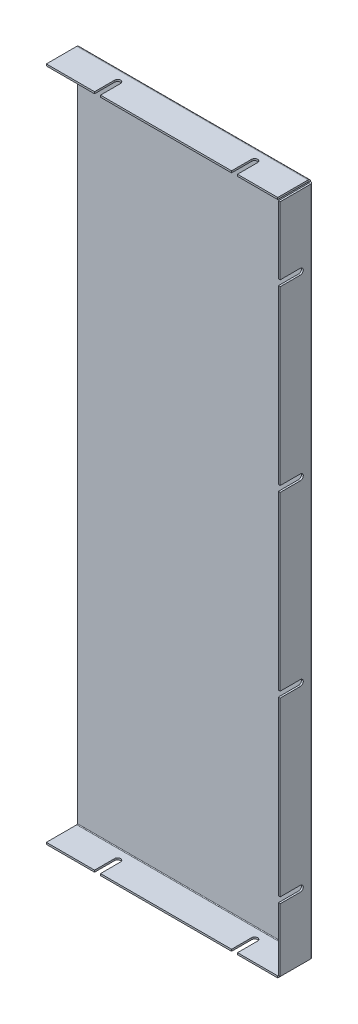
ISO-10303-21;
HEADER;
FILE_DESCRIPTION(('STEP AP214'),'2;1');
FILE_NAME('part.step','',(''),(''),'','','');
FILE_SCHEMA(('AUTOMOTIVE_DESIGN { 1 0 10303 214 1 1 1 1 }'));
ENDSEC;
DATA;
#1=APPLICATION_CONTEXT('core data for automotive mechanical design processes');
#2=APPLICATION_PROTOCOL_DEFINITION('international standard','automotive_design',2000,#1);
#3=PRODUCT_CONTEXT('',#1,'mechanical');
#4=PRODUCT('Part','Part','',(#3));
#5=PRODUCT_RELATED_PRODUCT_CATEGORY('part','',(#4));
#6=PRODUCT_DEFINITION_FORMATION('','',#4);
#7=PRODUCT_DEFINITION_CONTEXT('part definition',#1,'design');
#8=PRODUCT_DEFINITION('design','',#6,#7);
#9=PRODUCT_DEFINITION_SHAPE('','',#8);
#10=(LENGTH_UNIT() NAMED_UNIT(*) SI_UNIT(.MILLI.,.METRE.));
#11=(NAMED_UNIT(*) PLANE_ANGLE_UNIT() SI_UNIT($,.RADIAN.));
#12=(NAMED_UNIT(*) SI_UNIT($,.STERADIAN.) SOLID_ANGLE_UNIT());
#13=UNCERTAINTY_MEASURE_WITH_UNIT(LENGTH_MEASURE(1.E-05),#10,'distance_accuracy_value','');
#14=(GEOMETRIC_REPRESENTATION_CONTEXT(3) GLOBAL_UNCERTAINTY_ASSIGNED_CONTEXT((#13)) GLOBAL_UNIT_ASSIGNED_CONTEXT((#10,
#11,#12)) REPRESENTATION_CONTEXT('',''));
#15=CARTESIAN_POINT('',(0.,0.,0.));
#16=DIRECTION('',(0.,0.,1.));
#17=DIRECTION('',(1.,0.,0.));
#18=AXIS2_PLACEMENT_3D('',#15,#16,#17);
#19=CARTESIAN_POINT('',(576.,20.,34.));
#20=DIRECTION('',(0.,0.,-1.));
#21=DIRECTION('',(-1.,0.,0.));
#22=AXIS2_PLACEMENT_3D('',#19,#20,#21);
#23=PLANE('',#22);
#24=DIRECTION('',(0.,1.,0.));
#25=VECTOR('',#24,1.);
#26=CARTESIAN_POINT('',(574.,20.,34.));
#27=LINE('',#26,#25);
#28=CARTESIAN_POINT('',(574.,286.75,34.));
#29=VERTEX_POINT('',#28);
#30=CARTESIAN_POINT('',(574.,98.25,33.9999999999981));
#31=VERTEX_POINT('',#30);
#32=EDGE_CURVE('E395',#29,#31,#27,.F.);
#33=ORIENTED_EDGE('',*,*,#32,.T.);
#34=DIRECTION('',(1.,0.,0.));
#35=VECTOR('',#34,1.);
#36=CARTESIAN_POINT('',(576.,98.25,34.));
#37=LINE('',#36,#35);
#38=CARTESIAN_POINT('',(576.,98.25,33.9999999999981));
#39=VERTEX_POINT('',#38);
#40=EDGE_CURVE('E24',#31,#39,#37,.T.);
#41=ORIENTED_EDGE('',*,*,#40,.T.);
#42=DIRECTION('',(0.,-1.,0.));
#43=VECTOR('',#42,1.);
#44=CARTESIAN_POINT('',(576.,0.,34.));
#45=LINE('',#44,#43);
#46=CARTESIAN_POINT('',(576.,286.75,33.9999999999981));
#47=VERTEX_POINT('',#46);
#48=EDGE_CURVE('E344',#47,#39,#45,.T.);
#49=ORIENTED_EDGE('',*,*,#48,.F.);
#50=DIRECTION('',(-1.,0.,0.));
#51=VECTOR('',#50,1.);
#52=CARTESIAN_POINT('',(576.,286.75,34.));
#53=LINE('',#52,#51);
#54=EDGE_CURVE('E384',#47,#29,#53,.T.);
#55=ORIENTED_EDGE('',*,*,#54,.T.);
#56=EDGE_LOOP('',(#33,#41,#49,#55));
#57=FACE_BOUND('',#56,.T.);
#58=ADVANCED_FACE('F16',(#57),#23,.F.);
#59=CARTESIAN_POINT('',(574.,481.75,34.));
#60=VERTEX_POINT('',#59);
#61=CARTESIAN_POINT('',(574.,293.25,33.9999999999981));
#62=VERTEX_POINT('',#61);
#63=EDGE_CURVE('E381',#60,#62,#27,.F.);
#64=ORIENTED_EDGE('',*,*,#63,.T.);
#65=DIRECTION('',(1.,0.,0.));
#66=VECTOR('',#65,1.);
#67=CARTESIAN_POINT('',(576.,293.25,34.));
#68=LINE('',#67,#66);
#69=CARTESIAN_POINT('',(576.,293.25,33.9999999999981));
#70=VERTEX_POINT('',#69);
#71=EDGE_CURVE('E380',#62,#70,#68,.T.);
#72=ORIENTED_EDGE('',*,*,#71,.T.);
#73=CARTESIAN_POINT('',(576.,481.75,33.9999999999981));
#74=VERTEX_POINT('',#73);
#75=EDGE_CURVE('E348',#74,#70,#45,.T.);
#76=ORIENTED_EDGE('',*,*,#75,.F.);
#77=DIRECTION('',(-1.,0.,0.));
#78=VECTOR('',#77,1.);
#79=CARTESIAN_POINT('',(576.,481.75,34.));
#80=LINE('',#79,#78);
#81=EDGE_CURVE('E378',#74,#60,#80,.T.);
#82=ORIENTED_EDGE('',*,*,#81,.T.);
#83=EDGE_LOOP('',(#64,#72,#76,#82));
#84=FACE_BOUND('',#83,.T.);
#85=ADVANCED_FACE('F377',(#84),#23,.F.);
#86=CARTESIAN_POINT('',(574.,676.75,34.));
#87=VERTEX_POINT('',#86);
#88=CARTESIAN_POINT('',(574.,488.25,33.9999999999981));
#89=VERTEX_POINT('',#88);
#90=EDGE_CURVE('E350',#87,#89,#27,.F.);
#91=ORIENTED_EDGE('',*,*,#90,.T.);
#92=DIRECTION('',(1.,0.,0.));
#93=VECTOR('',#92,1.);
#94=CARTESIAN_POINT('',(576.,488.25,34.));
#95=LINE('',#94,#93);
#96=CARTESIAN_POINT('',(576.,488.25,33.9999999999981));
#97=VERTEX_POINT('',#96);
#98=EDGE_CURVE('E777',#89,#97,#95,.T.);
#99=ORIENTED_EDGE('',*,*,#98,.T.);
#100=CARTESIAN_POINT('',(576.,676.75,33.9999999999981));
#101=VERTEX_POINT('',#100);
#102=EDGE_CURVE('E356',#101,#97,#45,.T.);
#103=ORIENTED_EDGE('',*,*,#102,.F.);
#104=DIRECTION('',(-1.,0.,0.));
#105=VECTOR('',#104,1.);
#106=CARTESIAN_POINT('',(576.,676.75,34.));
#107=LINE('',#106,#105);
#108=EDGE_CURVE('E778',#101,#87,#107,.T.);
#109=ORIENTED_EDGE('',*,*,#108,.T.);
#110=EDGE_LOOP('',(#91,#99,#103,#109));
#111=FACE_BOUND('',#110,.T.);
#112=ADVANCED_FACE('F761',(#111),#23,.F.);
#113=CARTESIAN_POINT('',(574.,757.292893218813,34.));
#114=VERTEX_POINT('',#113);
#115=CARTESIAN_POINT('',(574.,683.25,33.9999999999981));
#116=VERTEX_POINT('',#115);
#117=EDGE_CURVE('E345',#114,#116,#27,.F.);
#118=ORIENTED_EDGE('',*,*,#117,.T.);
#119=DIRECTION('',(1.,0.,0.));
#120=VECTOR('',#119,1.);
#121=CARTESIAN_POINT('',(576.,683.25,34.));
#122=LINE('',#121,#120);
#123=CARTESIAN_POINT('',(576.,683.25,33.9999999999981));
#124=VERTEX_POINT('',#123);
#125=EDGE_CURVE('E835',#116,#124,#122,.T.);
#126=ORIENTED_EDGE('',*,*,#125,.T.);
#127=CARTESIAN_POINT('',(576.,757.292893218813,34.));
#128=VERTEX_POINT('',#127);
#129=EDGE_CURVE('E347',#128,#124,#45,.T.);
#130=ORIENTED_EDGE('',*,*,#129,.F.);
#131=DIRECTION('',(-1.,0.,0.));
#132=VECTOR('',#131,1.);
#133=CARTESIAN_POINT('',(576.,757.292893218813,34.));
#134=LINE('',#133,#132);
#135=EDGE_CURVE('E792',#128,#114,#134,.T.);
#136=ORIENTED_EDGE('',*,*,#135,.T.);
#137=EDGE_LOOP('',(#118,#126,#130,#136));
#138=FACE_BOUND('',#137,.T.);
#139=ADVANCED_FACE('F629',(#138),#23,.F.);
#140=CARTESIAN_POINT('',(576.,760.,34.));
#141=DIRECTION('',(0.,0.,-1.));
#142=DIRECTION('',(0.,1.,0.));
#143=AXIS2_PLACEMENT_3D('',#140,#141,#142);
#144=PLANE('',#143);
#145=DIRECTION('',(1.,0.,0.));
#146=VECTOR('',#145,1.);
#147=CARTESIAN_POINT('',(0.,760.,34.));
#148=LINE('',#147,#146);
#149=CARTESIAN_POINT('',(379.25,760.,33.9999999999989));
#150=VERTEX_POINT('',#149);
#151=CARTESIAN_POINT('',(522.75,760.,34.));
#152=VERTEX_POINT('',#151);
#153=EDGE_CURVE('E671',#150,#152,#148,.T.);
#154=ORIENTED_EDGE('',*,*,#153,.F.);
#155=DIRECTION('',(0.,-1.,0.));
#156=VECTOR('',#155,1.);
#157=CARTESIAN_POINT('',(379.25,760.,33.9999999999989));
#158=LINE('',#157,#156);
#159=CARTESIAN_POINT('',(379.25,758.,33.9999999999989));
#160=VERTEX_POINT('',#159);
#161=EDGE_CURVE('E466',#150,#160,#158,.T.);
#162=ORIENTED_EDGE('',*,*,#161,.T.);
#163=DIRECTION('',(-1.,0.,0.));
#164=VECTOR('',#163,1.);
#165=CARTESIAN_POINT('',(576.,758.,34.));
#166=LINE('',#165,#164);
#167=CARTESIAN_POINT('',(522.75,758.,34.));
#168=VERTEX_POINT('',#167);
#169=EDGE_CURVE('E678',#160,#168,#166,.F.);
#170=ORIENTED_EDGE('',*,*,#169,.T.);
#171=DIRECTION('',(0.,-1.,0.));
#172=VECTOR('',#171,1.);
#173=CARTESIAN_POINT('',(522.75,760.,34.));
#174=LINE('',#173,#172);
#175=EDGE_CURVE('E499',#152,#168,#174,.T.);
#176=ORIENTED_EDGE('',*,*,#175,.F.);
#177=EDGE_LOOP('',(#154,#162,#170,#176));
#178=FACE_BOUND('',#177,.T.);
#179=ADVANCED_FACE('F771',(#178),#144,.F.);
#180=CARTESIAN_POINT('',(320.,20.,34.));
#181=DIRECTION('',(0.,0.,-1.));
#182=DIRECTION('',(0.,1.,0.));
#183=AXIS2_PLACEMENT_3D('',#180,#181,#182);
#184=PLANE('',#183);
#185=DIRECTION('',(1.,0.,0.));
#186=VECTOR('',#185,1.);
#187=CARTESIAN_POINT('',(320.,22.,34.));
#188=LINE('',#187,#186);
#189=CARTESIAN_POINT('',(522.75,22.,34.));
#190=VERTEX_POINT('',#189);
#191=CARTESIAN_POINT('',(379.25,22.,33.9999999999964));
#192=VERTEX_POINT('',#191);
#193=EDGE_CURVE('E548',#190,#192,#188,.F.);
#194=ORIENTED_EDGE('',*,*,#193,.T.);
#195=DIRECTION('',(0.,-1.,0.));
#196=VECTOR('',#195,1.);
#197=CARTESIAN_POINT('',(379.25,20.,34.));
#198=LINE('',#197,#196);
#199=CARTESIAN_POINT('',(379.25,20.,33.9999999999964));
#200=VERTEX_POINT('',#199);
#201=EDGE_CURVE('E924',#192,#200,#198,.T.);
#202=ORIENTED_EDGE('',*,*,#201,.T.);
#203=DIRECTION('',(-1.,0.,0.));
#204=VECTOR('',#203,1.);
#205=CARTESIAN_POINT('',(0.,19.9999999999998,34.));
#206=LINE('',#205,#204);
#207=CARTESIAN_POINT('',(522.75,20.,33.9999999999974));
#208=VERTEX_POINT('',#207);
#209=EDGE_CURVE('E540',#208,#200,#206,.T.);
#210=ORIENTED_EDGE('',*,*,#209,.F.);
#211=DIRECTION('',(0.,1.,0.));
#212=VECTOR('',#211,1.);
#213=CARTESIAN_POINT('',(522.75,20.,34.));
#214=LINE('',#213,#212);
#215=EDGE_CURVE('E910',#208,#190,#214,.T.);
#216=ORIENTED_EDGE('',*,*,#215,.T.);
#217=EDGE_LOOP('',(#194,#202,#210,#216));
#218=FACE_BOUND('',#217,.T.);
#219=ADVANCED_FACE('F940',(#218),#184,.F.);
#220=CARTESIAN_POINT('',(529.25,760.,34.));
#221=VERTEX_POINT('',#220);
#222=CARTESIAN_POINT('',(573.292893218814,760.,34.));
#223=VERTEX_POINT('',#222);
#224=EDGE_CURVE('E672',#221,#223,#148,.T.);
#225=ORIENTED_EDGE('',*,*,#224,.F.);
#226=DIRECTION('',(0.,-1.,0.));
#227=VECTOR('',#226,1.);
#228=CARTESIAN_POINT('',(529.25,760.,34.));
#229=LINE('',#228,#227);
#230=CARTESIAN_POINT('',(529.25,758.,34.));
#231=VERTEX_POINT('',#230);
#232=EDGE_CURVE('E506',#221,#231,#229,.T.);
#233=ORIENTED_EDGE('',*,*,#232,.T.);
#234=CARTESIAN_POINT('',(573.292893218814,758.,34.));
#235=VERTEX_POINT('',#234);
#236=EDGE_CURVE('E679',#231,#235,#166,.F.);
#237=ORIENTED_EDGE('',*,*,#236,.T.);
#238=DIRECTION('',(0.,1.,0.));
#239=VECTOR('',#238,1.);
#240=CARTESIAN_POINT('',(573.292893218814,758.,34.));
#241=LINE('',#240,#239);
#242=EDGE_CURVE('E689',#223,#235,#241,.F.);
#243=ORIENTED_EDGE('',*,*,#242,.F.);
#244=EDGE_LOOP('',(#225,#233,#237,#243));
#245=FACE_BOUND('',#244,.T.);
#246=ADVANCED_FACE('F1215',(#245),#144,.F.);
#247=CARTESIAN_POINT('',(573.292893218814,22.,34.));
#248=VERTEX_POINT('',#247);
#249=CARTESIAN_POINT('',(529.25,22.,33.9999999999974));
#250=VERTEX_POINT('',#249);
#251=EDGE_CURVE('E545',#248,#250,#188,.F.);
#252=ORIENTED_EDGE('',*,*,#251,.T.);
#253=DIRECTION('',(0.,-1.,0.));
#254=VECTOR('',#253,1.);
#255=CARTESIAN_POINT('',(529.25,20.,34.));
#256=LINE('',#255,#254);
#257=CARTESIAN_POINT('',(529.25,20.,33.9999999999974));
#258=VERTEX_POINT('',#257);
#259=EDGE_CURVE('E917',#250,#258,#256,.T.);
#260=ORIENTED_EDGE('',*,*,#259,.T.);
#261=CARTESIAN_POINT('',(573.292893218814,20.,34.));
#262=VERTEX_POINT('',#261);
#263=EDGE_CURVE('E537',#262,#258,#206,.T.);
#264=ORIENTED_EDGE('',*,*,#263,.F.);
#265=DIRECTION('',(0.,1.,0.));
#266=VECTOR('',#265,1.);
#267=CARTESIAN_POINT('',(573.292893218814,20.,34.));
#268=LINE('',#267,#266);
#269=EDGE_CURVE('E560',#262,#248,#268,.T.);
#270=ORIENTED_EDGE('',*,*,#269,.T.);
#271=EDGE_LOOP('',(#252,#260,#264,#270));
#272=FACE_BOUND('',#271,.T.);
#273=ADVANCED_FACE('F745',(#272),#184,.F.);
#274=CARTESIAN_POINT('',(0.,0.,-2.));
#275=DIRECTION('',(0.,0.,1.));
#276=DIRECTION('',(1.,0.,0.));
#277=AXIS2_PLACEMENT_3D('',#274,#275,#276);
#278=PLANE('',#277);
#279=DIRECTION('',(1.,0.,0.));
#280=VECTOR('',#279,1.);
#281=CARTESIAN_POINT('',(573.292893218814,22.7366,-2.00000000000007));
#282=LINE('',#281,#280);
#283=CARTESIAN_POINT('',(573.2634,22.7366,-2.00000000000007));
#284=VERTEX_POINT('',#283);
#285=CARTESIAN_POINT('',(320.,22.7366,-2.));
#286=VERTEX_POINT('',#285);
#287=EDGE_CURVE('E570',#284,#286,#282,.F.);
#288=ORIENTED_EDGE('',*,*,#287,.T.);
#289=DIRECTION('',(0.,-1.,0.));
#290=VECTOR('',#289,1.);
#291=CARTESIAN_POINT('',(320.,20.,-2.));
#292=LINE('',#291,#290);
#293=CARTESIAN_POINT('',(320.,757.2634,-2.));
#294=VERTEX_POINT('',#293);
#295=EDGE_CURVE('E908',#294,#286,#292,.T.);
#296=ORIENTED_EDGE('',*,*,#295,.F.);
#297=DIRECTION('',(-1.,0.,0.));
#298=VECTOR('',#297,1.);
#299=CARTESIAN_POINT('',(320.,757.2634,-2.));
#300=LINE('',#299,#298);
#301=CARTESIAN_POINT('',(573.2634,757.2634,-2.));
#302=VERTEX_POINT('',#301);
#303=EDGE_CURVE('E700',#294,#302,#300,.F.);
#304=ORIENTED_EDGE('',*,*,#303,.T.);
#305=DIRECTION('',(0.,1.,0.));
#306=VECTOR('',#305,1.);
#307=CARTESIAN_POINT('',(573.2634,757.292893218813,-2.));
#308=LINE('',#307,#306);
#309=EDGE_CURVE('E649',#302,#284,#308,.F.);
#310=ORIENTED_EDGE('',*,*,#309,.T.);
#311=EDGE_LOOP('',(#288,#296,#304,#310));
#312=FACE_BOUND('',#311,.T.);
#313=ADVANCED_FACE('F742',(#312),#278,.F.);
#314=CARTESIAN_POINT('',(0.,0.,0.));
#315=DIRECTION('',(0.,0.,1.));
#316=DIRECTION('',(1.,0.,0.));
#317=AXIS2_PLACEMENT_3D('',#314,#315,#316);
#318=PLANE('',#317);
#319=DIRECTION('',(0.,-1.,0.));
#320=VECTOR('',#319,1.);
#321=CARTESIAN_POINT('',(320.,20.,0.));
#322=LINE('',#321,#320);
#323=CARTESIAN_POINT('',(320.,757.2634,0.));
#324=VERTEX_POINT('',#323);
#325=CARTESIAN_POINT('',(320.,22.7366,0.));
#326=VERTEX_POINT('',#325);
#327=EDGE_CURVE('E905',#324,#326,#322,.T.);
#328=ORIENTED_EDGE('',*,*,#327,.T.);
#329=DIRECTION('',(1.,0.,0.));
#330=VECTOR('',#329,1.);
#331=CARTESIAN_POINT('',(573.292893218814,22.7366,0.));
#332=LINE('',#331,#330);
#333=CARTESIAN_POINT('',(573.2634,22.7366,0.));
#334=VERTEX_POINT('',#333);
#335=EDGE_CURVE('E575',#334,#326,#332,.F.);
#336=ORIENTED_EDGE('',*,*,#335,.F.);
#337=DIRECTION('',(0.,1.,0.));
#338=VECTOR('',#337,1.);
#339=CARTESIAN_POINT('',(573.2634,757.292893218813,0.));
#340=LINE('',#339,#338);
#341=CARTESIAN_POINT('',(573.2634,757.2634,0.));
#342=VERTEX_POINT('',#341);
#343=EDGE_CURVE('E799',#342,#334,#340,.F.);
#344=ORIENTED_EDGE('',*,*,#343,.F.);
#345=DIRECTION('',(-1.,0.,0.));
#346=VECTOR('',#345,1.);
#347=CARTESIAN_POINT('',(320.,757.2634,0.));
#348=LINE('',#347,#346);
#349=EDGE_CURVE('E704',#324,#342,#348,.F.);
#350=ORIENTED_EDGE('',*,*,#349,.F.);
#351=EDGE_LOOP('',(#328,#336,#344,#350));
#352=FACE_BOUND('',#351,.T.);
#353=ADVANCED_FACE('F744',(#352),#318,.T.);
#354=CARTESIAN_POINT('',(320.,20.,-2.));
#355=DIRECTION('',(-1.,0.,0.));
#356=DIRECTION('',(0.,0.,1.));
#357=AXIS2_PLACEMENT_3D('',#354,#355,#356);
#358=PLANE('',#357);
#359=DIRECTION('',(0.,0.,-1.));
#360=VECTOR('',#359,1.);
#361=CARTESIAN_POINT('',(320.,22.7366,0.));
#362=LINE('',#361,#360);
#363=EDGE_CURVE('E569',#326,#286,#362,.T.);
#364=ORIENTED_EDGE('',*,*,#363,.F.);
#365=ORIENTED_EDGE('',*,*,#327,.F.);
#366=DIRECTION('',(0.,0.,-1.));
#367=VECTOR('',#366,1.);
#368=CARTESIAN_POINT('',(320.,757.2634,0.));
#369=LINE('',#368,#367);
#370=EDGE_CURVE('E912',#324,#294,#369,.T.);
#371=ORIENTED_EDGE('',*,*,#370,.T.);
#372=ORIENTED_EDGE('',*,*,#295,.T.);
#373=EDGE_LOOP('',(#364,#365,#371,#372));
#374=FACE_BOUND('',#373,.T.);
#375=ADVANCED_FACE('F18',(#374),#358,.T.);
#376=CARTESIAN_POINT('',(573.2634,757.2634,-2.02));
#377=CARTESIAN_POINT('',(573.265858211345,757.624303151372,-2.02));
#378=CARTESIAN_POINT('',(573.268315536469,757.984934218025,-1.9482530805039));
#379=CARTESIAN_POINT('',(573.273231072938,758.65167608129,-1.67207955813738));
#380=CARTESIAN_POINT('',(573.275688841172,758.957459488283,-1.46776161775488));
#381=CARTESIAN_POINT('',(573.280604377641,759.467761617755,-0.957459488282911));
#382=CARTESIAN_POINT('',(573.283062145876,759.672079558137,-0.651676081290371));
#383=CARTESIAN_POINT('',(573.287977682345,759.948253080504,0.0150657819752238));
#384=CARTESIAN_POINT('',(573.290435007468,760.02,0.375696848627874));
#385=CARTESIAN_POINT('',(573.292893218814,760.02,0.73659999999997));
#386=CARTESIAN_POINT('',(573.2634,757.2634,-2.));
#387=CARTESIAN_POINT('',(573.265858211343,757.621684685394,-2.));
#388=CARTESIAN_POINT('',(573.268315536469,757.979699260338,-1.92877362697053));
#389=CARTESIAN_POINT('',(573.273231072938,758.641603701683,-1.65460383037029));
#390=CARTESIAN_POINT('',(573.275688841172,758.945168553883,-1.45176828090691));
#391=CARTESIAN_POINT('',(573.280604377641,759.451768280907,-0.945168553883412));
#392=CARTESIAN_POINT('',(573.283062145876,759.65460383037,-0.641603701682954));
#393=CARTESIAN_POINT('',(573.287977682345,759.928773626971,0.0203007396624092));
#394=CARTESIAN_POINT('',(573.290435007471,760.,0.378315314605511));
#395=CARTESIAN_POINT('',(573.292893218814,760.,0.73659999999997));
#396=CARTESIAN_POINT('',(573.2634,757.2634,0.));
#397=CARTESIAN_POINT('',(573.265858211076,757.359838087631,0.));
#398=CARTESIAN_POINT('',(573.268315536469,757.456203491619,0.0191717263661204));
#399=CARTESIAN_POINT('',(573.273231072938,757.634365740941,0.0929689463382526));
#400=CARTESIAN_POINT('',(573.275688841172,757.716075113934,0.147565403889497));
#401=CARTESIAN_POINT('',(573.280604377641,757.852434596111,0.28392488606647));
#402=CARTESIAN_POINT('',(573.283062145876,757.907031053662,0.365634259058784));
#403=CARTESIAN_POINT('',(573.287977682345,757.980828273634,0.543796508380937));
#404=CARTESIAN_POINT('',(573.290435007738,758.,0.640161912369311));
#405=CARTESIAN_POINT('',(573.292893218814,758.,0.736599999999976));
#406=CARTESIAN_POINT('',(573.2634,757.2634,0.0202000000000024));
#407=CARTESIAN_POINT('',(573.265858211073,757.357193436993,0.0202000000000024));
#408=CARTESIAN_POINT('',(573.268315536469,757.450916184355,0.0388459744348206));
#409=CARTESIAN_POINT('',(573.273231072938,757.624192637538,0.110619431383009));
#410=CARTESIAN_POINT('',(573.275688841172,757.70366127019,0.163718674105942));
#411=CARTESIAN_POINT('',(573.280604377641,757.836281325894,0.296338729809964));
#412=CARTESIAN_POINT('',(573.283062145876,757.889380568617,0.375807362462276));
#413=CARTESIAN_POINT('',(573.287977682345,757.961154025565,0.549083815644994));
#414=CARTESIAN_POINT('',(573.290435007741,757.9798,0.642806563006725));
#415=CARTESIAN_POINT('',(573.292893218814,757.9798,0.736599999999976));
#416=B_SPLINE_SURFACE_WITH_KNOTS('',1,3,((#376,#377,#378,#379,#380,#381,#382,#383,#384,#385),
(#386,#387,#388,#389,#390,#391,#392,#393,#394,#395),(#396,#397,#398,#399,#400,#401,#402,#403,
#404,#405),(#406,#407,#408,#409,#410,#411,#412,#413,#414,#415)),.UNSPECIFIED.,.F.,.F.,.F.,(2,1,
1,2),(4,2,2,2,4),(-0.01,0.,1.,1.0101),(0.,0.25,0.5,0.75,1.),.UNSPECIFIED.);
#417=DIRECTION('',(0.,-1.,0.));
#418=VECTOR('',#417,1.);
#419=CARTESIAN_POINT('',(573.292893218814,758.,0.736599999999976));
#420=LINE('',#419,#418);
#421=CARTESIAN_POINT('',(573.292893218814,760.,0.73659999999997));
#422=VERTEX_POINT('',#421);
#423=CARTESIAN_POINT('',(573.292893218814,758.,0.736599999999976));
#424=VERTEX_POINT('',#423);
#425=EDGE_CURVE('E662',#422,#424,#420,.T.);
#426=CARTESIAN_POINT('',(573.2634,757.2634,0.));
#427=CARTESIAN_POINT('',(573.263707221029,757.275452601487,-2.55665581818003E-07));
#428=CARTESIAN_POINT('',(573.264014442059,757.287505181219,0.000295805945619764));
#429=CARTESIAN_POINT('',(573.264628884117,757.3115813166,0.00147872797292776));
#430=CARTESIAN_POINT('',(573.264936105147,757.323604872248,0.00236558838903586));
#431=CARTESIAN_POINT('',(573.265550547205,757.347593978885,0.00472827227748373));
#432=CARTESIAN_POINT('',(573.265857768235,757.359559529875,0.00620409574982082));
#433=CARTESIAN_POINT('',(573.266472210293,757.383403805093,0.00974106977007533));
#434=CARTESIAN_POINT('',(573.266779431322,757.395282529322,0.0118022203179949));
#435=CARTESIAN_POINT('',(573.267393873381,757.418924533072,0.0165049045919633));
#436=CARTESIAN_POINT('',(573.26770109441,757.430687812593,0.0191464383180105));
#437=CARTESIAN_POINT('',(573.268315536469,757.45407058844,0.0250035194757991));
#438=CARTESIAN_POINT('',(573.268622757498,757.465690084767,0.0282190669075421));
#439=CARTESIAN_POINT('',(573.269237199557,757.488757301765,0.0352164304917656));
#440=CARTESIAN_POINT('',(573.269544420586,757.500205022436,0.0389982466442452));
#441=CARTESIAN_POINT('',(573.270158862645,757.522901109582,0.0471190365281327));
#442=CARTESIAN_POINT('',(573.270466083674,757.534149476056,0.0514580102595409));
#443=CARTESIAN_POINT('',(573.271080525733,757.556419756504,0.0606826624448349));
#444=CARTESIAN_POINT('',(573.271387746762,757.567441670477,0.0655683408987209));
#445=CARTESIAN_POINT('',(573.272002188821,757.589232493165,0.0758746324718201));
#446=CARTESIAN_POINT('',(573.27230940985,757.600001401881,0.0812952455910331));
#447=CARTESIAN_POINT('',(573.272923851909,757.621260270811,0.0926583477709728));
#448=CARTESIAN_POINT('',(573.273231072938,757.631750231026,0.0986008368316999));
#449=CARTESIAN_POINT('',(573.273845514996,757.65242593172,0.110993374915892));
#450=CARTESIAN_POINT('',(573.274152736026,757.6626116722,0.117443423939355));
#451=CARTESIAN_POINT('',(573.274767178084,757.682654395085,0.130835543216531));
#452=CARTESIAN_POINT('',(573.275074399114,757.692511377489,0.137777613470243));
#453=CARTESIAN_POINT('',(573.275688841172,757.711872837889,0.152137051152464));
#454=CARTESIAN_POINT('',(573.275996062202,757.721377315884,0.159554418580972));
#455=CARTESIAN_POINT('',(573.27661050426,757.740010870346,0.174846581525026));
#456=CARTESIAN_POINT('',(573.27691772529,757.749139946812,0.182721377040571));
#457=CARTESIAN_POINT('',(573.277532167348,757.767000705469,0.198909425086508));
#458=CARTESIAN_POINT('',(573.277839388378,757.775732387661,0.2072226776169));
#459=CARTESIAN_POINT('',(573.278453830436,757.792777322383,0.224267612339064));
#460=CARTESIAN_POINT('',(573.278761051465,757.801090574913,0.232999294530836));
#461=CARTESIAN_POINT('',(573.279375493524,757.817278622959,0.250860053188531));
#462=CARTESIAN_POINT('',(573.279682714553,757.825153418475,0.259989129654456));
#463=CARTESIAN_POINT('',(573.280297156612,757.840445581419,0.278622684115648));
#464=CARTESIAN_POINT('',(573.280604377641,757.847862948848,0.288127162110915));
#465=CARTESIAN_POINT('',(573.2812188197,757.86222238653,0.307488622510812));
#466=CARTESIAN_POINT('',(573.281526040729,757.869164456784,0.317345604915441));
#467=CARTESIAN_POINT('',(573.282140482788,757.882556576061,0.337388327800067));
#468=CARTESIAN_POINT('',(573.282447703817,757.889006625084,0.347574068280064));
#469=CARTESIAN_POINT('',(573.283062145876,757.901399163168,0.368249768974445));
#470=CARTESIAN_POINT('',(573.283369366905,757.907341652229,0.378739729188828));
#471=CARTESIAN_POINT('',(573.283983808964,757.918704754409,0.399998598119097));
#472=CARTESIAN_POINT('',(573.284291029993,757.924125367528,0.410767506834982));
#473=CARTESIAN_POINT('',(573.284905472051,757.934431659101,0.432558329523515));
#474=CARTESIAN_POINT('',(573.285212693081,757.939317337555,0.443580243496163));
#475=CARTESIAN_POINT('',(573.28582713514,757.948541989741,0.465850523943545));
#476=CARTESIAN_POINT('',(573.286134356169,757.952880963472,0.477098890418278));
#477=CARTESIAN_POINT('',(573.286748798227,757.961001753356,0.499794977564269));
#478=CARTESIAN_POINT('',(573.287056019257,757.964783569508,0.511242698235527));
#479=CARTESIAN_POINT('',(573.287670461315,757.971780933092,0.534309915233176));
#480=CARTESIAN_POINT('',(573.287977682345,757.974996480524,0.545929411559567));
#481=CARTESIAN_POINT('',(573.288592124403,757.980853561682,0.569312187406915));
#482=CARTESIAN_POINT('',(573.288899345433,757.983495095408,0.58107546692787));
#483=CARTESIAN_POINT('',(573.289513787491,757.988197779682,0.604717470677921));
#484=CARTESIAN_POINT('',(573.28982100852,757.99025893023,0.616596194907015));
#485=CARTESIAN_POINT('',(573.290435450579,757.99379590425,0.640440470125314));
#486=CARTESIAN_POINT('',(573.290742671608,757.995271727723,0.652406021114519));
#487=CARTESIAN_POINT('',(573.291357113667,757.997634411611,0.676395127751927));
#488=CARTESIAN_POINT('',(573.291664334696,757.998521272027,0.688418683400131));
#489=CARTESIAN_POINT('',(573.292278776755,757.999704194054,0.712494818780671));
#490=CARTESIAN_POINT('',(573.292585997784,758.000000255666,0.724547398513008));
#491=CARTESIAN_POINT('',(573.292893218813,758.,0.736599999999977));
#492=B_SPLINE_CURVE_WITH_KNOTS('',3,(#426,#427,#428,#429,#430,#431,#432,#433,#434,#435,#436,
#437,#438,#439,#440,#441,#442,#443,#444,#445,#446,#447,#448,#449,#450,#451,#452,#453,#454,#455,
#456,#457,#458,#459,#460,#461,#462,#463,#464,#465,#466,#467,#468,#469,#470,#471,#472,#473,#474,
#475,#476,#477,#478,#479,#480,#481,#482,#483,#484,#485,#486,#487,#488,#489,#490,#491),
.UNSPECIFIED.,.F.,.F.,(4,2,2,2,2,2,2,2,2,2,2,2,2,2,2,2,2,2,2,2,2,2,2,2,2,2,2,2,2,2,2,2,4),(0.,
0.0361658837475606,0.0723317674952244,0.108497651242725,0.144663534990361,0.180829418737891,
0.216995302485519,0.253161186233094,0.289327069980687,0.325492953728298,0.361658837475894,
0.397824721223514,0.433990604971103,0.470156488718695,0.50632237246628,0.54248825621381,
0.578654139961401,0.614820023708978,0.650985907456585,0.687151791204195,0.723317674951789,
0.7594835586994,0.795649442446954,0.831815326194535,0.867981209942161,0.90414709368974,
0.940312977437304,0.976478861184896,1.0126447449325,1.04881062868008,1.08497651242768,
1.12114239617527,1.15730827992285),.UNSPECIFIED.);
#493=EDGE_CURVE('E701',#342,#424,#492,.T.);
#494=DIRECTION('',(0.,0.,-1.));
#495=VECTOR('',#494,1.);
#496=CARTESIAN_POINT('',(573.2634,757.2634,0.));
#497=LINE('',#496,#495);
#498=EDGE_CURVE('E868',#342,#302,#497,.T.);
#499=CARTESIAN_POINT('',(573.2634,757.2634,-2.00000000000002));
#500=CARTESIAN_POINT('',(573.263707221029,757.308177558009,-2.00000094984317));
#501=CARTESIAN_POINT('',(573.264014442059,757.352955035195,-1.99890102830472));
#502=CARTESIAN_POINT('',(573.264628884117,757.442402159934,-1.99450626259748));
#503=CARTESIAN_POINT('',(573.264936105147,757.487071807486,-1.99121141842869));
#504=CARTESIAN_POINT('',(573.265550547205,757.576195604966,-1.98243362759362));
#505=CARTESIAN_POINT('',(573.265857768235,757.620649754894,-1.97695068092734));
#506=CARTESIAN_POINT('',(573.266472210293,757.709235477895,-1.96381019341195));
#507=CARTESIAN_POINT('',(573.266779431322,757.753367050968,-1.95615265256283));
#508=CARTESIAN_POINT('',(573.267393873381,757.841201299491,-1.93868134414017));
#509=CARTESIAN_POINT('',(573.26770109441,757.884903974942,-1.92886757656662));
#510=CARTESIAN_POINT('',(573.268315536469,757.971775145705,-1.90710747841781));
#511=CARTESIAN_POINT('',(573.268622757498,758.014943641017,-1.89516114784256));
#512=CARTESIAN_POINT('',(573.269237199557,758.100642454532,-1.869164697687));
#513=CARTESIAN_POINT('',(573.269544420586,758.143172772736,-1.85511457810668));
#514=CARTESIAN_POINT('',(573.270158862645,758.22749277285,-1.82494439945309));
#515=CARTESIAN_POINT('',(573.270466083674,758.26928245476,-1.8088243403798));
#516=CARTESIAN_POINT('',(573.271080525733,758.352020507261,-1.77455311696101));
#517=CARTESIAN_POINT('',(573.271387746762,758.392968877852,-1.7564019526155));
#518=CARTESIAN_POINT('',(573.272002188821,758.47392565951,-1.71811224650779));
#519=CARTESIAN_POINT('',(573.27230940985,758.513934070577,-1.69797370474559));
#520=CARTESIAN_POINT('',(573.272923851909,758.592914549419,-1.65575775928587));
#521=CARTESIAN_POINT('',(573.273231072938,758.631886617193,-1.63368035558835));
#522=CARTESIAN_POINT('',(573.273845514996,758.708700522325,-1.58763987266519));
#523=CARTESIAN_POINT('',(573.274152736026,758.746542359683,-1.56367679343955));
#524=CARTESIAN_POINT('',(573.274767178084,758.82100463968,-1.51392268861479));
#525=CARTESIAN_POINT('',(573.275074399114,758.85762508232,-1.48813166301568));
#526=CARTESIAN_POINT('',(573.275688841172,758.929556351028,-1.43478379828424));
#527=CARTESIAN_POINT('',(573.275996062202,758.964867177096,-1.40722695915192));
#528=CARTESIAN_POINT('',(573.27661050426,759.034094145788,-1.35041385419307));
#529=CARTESIAN_POINT('',(573.27691772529,759.068010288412,-1.32115758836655));
#530=CARTESIAN_POINT('',(573.277532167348,759.134366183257,-1.26101611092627));
#531=CARTESIAN_POINT('',(573.277839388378,759.166805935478,-1.23013089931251));
#532=CARTESIAN_POINT('',(573.278453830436,759.230130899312,-1.16680593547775));
#533=CARTESIAN_POINT('',(573.278761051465,759.261016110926,-1.13436618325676));
#534=CARTESIAN_POINT('',(573.279375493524,759.321157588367,-1.068010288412));
#535=CARTESIAN_POINT('',(573.279682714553,759.350413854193,-1.03409414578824));
#536=CARTESIAN_POINT('',(573.280297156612,759.407226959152,-0.964867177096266));
#537=CARTESIAN_POINT('',(573.280604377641,759.434783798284,-0.929556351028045));
#538=CARTESIAN_POINT('',(573.2812188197,759.488131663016,-0.857625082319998));
#539=CARTESIAN_POINT('',(573.281526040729,759.513922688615,-0.821004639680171));
#540=CARTESIAN_POINT('',(573.282140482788,759.56367679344,-0.746542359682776));
#541=CARTESIAN_POINT('',(573.282447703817,759.587639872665,-0.708700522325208));
#542=CARTESIAN_POINT('',(573.283062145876,759.633680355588,-0.631886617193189));
#543=CARTESIAN_POINT('',(573.283369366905,759.655757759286,-0.592914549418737));
#544=CARTESIAN_POINT('',(573.283983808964,759.697973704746,-0.513934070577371));
#545=CARTESIAN_POINT('',(573.284291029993,759.718112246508,-0.473925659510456));
#546=CARTESIAN_POINT('',(573.284905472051,759.756401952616,-0.392968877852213));
#547=CARTESIAN_POINT('',(573.285212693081,759.774553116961,-0.352020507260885));
#548=CARTESIAN_POINT('',(573.28582713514,759.80882434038,-0.269282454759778));
#549=CARTESIAN_POINT('',(573.286134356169,759.824944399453,-0.227492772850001));
#550=CARTESIAN_POINT('',(573.286748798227,759.855114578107,-0.143172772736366));
#551=CARTESIAN_POINT('',(573.287056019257,759.869164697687,-0.100642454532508));
#552=CARTESIAN_POINT('',(573.287670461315,759.895161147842,-0.0149436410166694));
#553=CARTESIAN_POINT('',(573.287977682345,759.907107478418,0.0282248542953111));
#554=CARTESIAN_POINT('',(573.288592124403,759.928867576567,0.115096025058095));
#555=CARTESIAN_POINT('',(573.288899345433,759.93868134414,0.158798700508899));
#556=CARTESIAN_POINT('',(573.289513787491,759.956152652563,0.246632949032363));
#557=CARTESIAN_POINT('',(573.28982100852,759.963810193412,0.290764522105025));
#558=CARTESIAN_POINT('',(573.290435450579,759.976950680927,0.379350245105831));
#559=CARTESIAN_POINT('',(573.290742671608,759.982433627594,0.423804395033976));
#560=CARTESIAN_POINT('',(573.291357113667,759.991211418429,0.512928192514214));
#561=CARTESIAN_POINT('',(573.291664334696,759.994506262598,0.557597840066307));
#562=CARTESIAN_POINT('',(573.292278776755,759.998901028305,0.647044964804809));
#563=CARTESIAN_POINT('',(573.292585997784,760.000000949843,0.691822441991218));
#564=CARTESIAN_POINT('',(573.292893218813,760.,0.73659999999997));
#565=B_SPLINE_CURVE_WITH_KNOTS('',3,(#499,#500,#501,#502,#503,#504,#505,#506,#507,#508,#509,
#510,#511,#512,#513,#514,#515,#516,#517,#518,#519,#520,#521,#522,#523,#524,#525,#526,#527,#528,
#529,#530,#531,#532,#533,#534,#535,#536,#537,#538,#539,#540,#541,#542,#543,#544,#545,#546,#547,
#548,#549,#550,#551,#552,#553,#554,#555,#556,#557,#558,#559,#560,#561,#562,#563,#564),
.UNSPECIFIED.,.F.,.F.,(4,2,2,2,2,2,2,2,2,2,2,2,2,2,2,2,2,2,2,2,2,2,2,2,2,2,2,2,2,2,2,2,4),(0.,
0.13432221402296,0.268644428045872,0.402966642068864,0.537288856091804,0.671611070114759,
0.805933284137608,0.940255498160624,1.0745777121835,1.20889992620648,1.34322214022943,
1.4775443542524,1.61186656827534,1.74618878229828,1.88051099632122,2.01483321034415,
2.14915542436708,2.28347763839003,2.41779985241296,2.55212206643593,2.68644428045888,
2.82076649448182,2.95508870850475,3.08941092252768,3.22373313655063,3.35805535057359,
3.49237756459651,3.62669977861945,3.76102199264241,3.89534420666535,4.02966642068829,
4.16398863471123,4.29831084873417),.UNSPECIFIED.);
#566=EDGE_CURVE('E1490',#302,#422,#565,.T.);
#567=ORIENTED_EDGE('',*,*,#425,.T.);
#568=ORIENTED_EDGE('',*,*,#493,.F.);
#569=ORIENTED_EDGE('',*,*,#498,.T.);
#570=ORIENTED_EDGE('',*,*,#566,.T.);
#571=EDGE_LOOP('',(#567,#568,#569,#570));
#572=FACE_BOUND('',#571,.T.);
#573=ADVANCED_FACE('F727',(#572),#416,.F.);
#574=CARTESIAN_POINT('',(320.,757.2634,0.736599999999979));
#575=DIRECTION('',(1.,0.,0.));
#576=DIRECTION('',(0.,0.,-1.));
#577=AXIS2_PLACEMENT_3D('',#574,#575,#576);
#578=PLANE('',#577);
#579=CARTESIAN_POINT('',(320.,757.2634,0.736599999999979));
#580=DIRECTION('',(-1.,0.,0.));
#581=DIRECTION('',(0.,0.,1.));
#582=AXIS2_PLACEMENT_3D('',#579,#580,#581);
#583=CIRCLE('',#582,0.736599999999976);
#584=CARTESIAN_POINT('',(320.,758.,0.736599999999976));
#585=VERTEX_POINT('',#584);
#586=EDGE_CURVE('E664',#585,#324,#583,.T.);
#587=ORIENTED_EDGE('',*,*,#586,.F.);
#588=DIRECTION('',(0.,-1.,0.));
#589=VECTOR('',#588,1.);
#590=CARTESIAN_POINT('',(320.,758.,0.736599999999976));
#591=LINE('',#590,#589);
#592=CARTESIAN_POINT('',(320.,760.,0.73659999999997));
#593=VERTEX_POINT('',#592);
#594=EDGE_CURVE('E684',#585,#593,#591,.F.);
#595=ORIENTED_EDGE('',*,*,#594,.T.);
#596=CARTESIAN_POINT('',(320.,757.2634,0.736599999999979));
#597=DIRECTION('',(-1.,0.,0.));
#598=DIRECTION('',(0.,0.,1.));
#599=AXIS2_PLACEMENT_3D('',#596,#597,#598);
#600=CIRCLE('',#599,2.7366);
#601=EDGE_CURVE('E697',#593,#294,#600,.T.);
#602=ORIENTED_EDGE('',*,*,#601,.T.);
#603=ORIENTED_EDGE('',*,*,#370,.F.);
#604=EDGE_LOOP('',(#587,#595,#602,#603));
#605=FACE_BOUND('',#604,.T.);
#606=ADVANCED_FACE('F732',(#605),#578,.F.);
#607=CARTESIAN_POINT('',(320.,757.2634,0.736599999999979));
#608=DIRECTION('',(-1.,0.,0.));
#609=DIRECTION('',(0.,1.,0.));
#610=AXIS2_PLACEMENT_3D('',#607,#608,#609);
#611=CYLINDRICAL_SURFACE('',#610,2.7366);
#612=ORIENTED_EDGE('',*,*,#303,.F.);
#613=ORIENTED_EDGE('',*,*,#601,.F.);
#614=DIRECTION('',(-1.,0.,0.));
#615=VECTOR('',#614,1.);
#616=CARTESIAN_POINT('',(576.,760.,0.73659999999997));
#617=LINE('',#616,#615);
#618=EDGE_CURVE('E682',#593,#422,#617,.F.);
#619=ORIENTED_EDGE('',*,*,#618,.T.);
#620=ORIENTED_EDGE('',*,*,#566,.F.);
#621=EDGE_LOOP('',(#612,#613,#619,#620));
#622=FACE_BOUND('',#621,.T.);
#623=ADVANCED_FACE('F723',(#622),#611,.T.);
#624=CARTESIAN_POINT('',(320.,757.2634,0.736599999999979));
#625=DIRECTION('',(-1.,0.,0.));
#626=DIRECTION('',(0.,1.,0.));
#627=AXIS2_PLACEMENT_3D('',#624,#625,#626);
#628=CYLINDRICAL_SURFACE('',#627,0.736599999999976);
#629=ORIENTED_EDGE('',*,*,#349,.T.);
#630=ORIENTED_EDGE('',*,*,#493,.T.);
#631=DIRECTION('',(-1.,0.,0.));
#632=VECTOR('',#631,1.);
#633=CARTESIAN_POINT('',(576.,758.,0.736599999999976));
#634=LINE('',#633,#632);
#635=EDGE_CURVE('E687',#424,#585,#634,.T.);
#636=ORIENTED_EDGE('',*,*,#635,.T.);
#637=ORIENTED_EDGE('',*,*,#586,.T.);
#638=EDGE_LOOP('',(#629,#630,#636,#637));
#639=FACE_BOUND('',#638,.T.);
#640=ADVANCED_FACE('F712',(#639),#628,.F.);
#641=CARTESIAN_POINT('',(573.292893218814,758.,0.));
#642=DIRECTION('',(1.,0.,0.));
#643=DIRECTION('',(0.,0.,-1.));
#644=AXIS2_PLACEMENT_3D('',#641,#642,#643);
#645=PLANE('',#644);
#646=DIRECTION('',(0.,0.,-1.));
#647=VECTOR('',#646,1.);
#648=CARTESIAN_POINT('',(573.292893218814,760.,0.));
#649=LINE('',#648,#647);
#650=EDGE_CURVE('E692',#422,#223,#649,.F.);
#651=ORIENTED_EDGE('',*,*,#650,.T.);
#652=ORIENTED_EDGE('',*,*,#242,.T.);
#653=DIRECTION('',(0.,0.,1.));
#654=VECTOR('',#653,1.);
#655=CARTESIAN_POINT('',(573.292893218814,758.,-2.48167499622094E-12));
#656=LINE('',#655,#654);
#657=EDGE_CURVE('E661',#424,#235,#656,.T.);
#658=ORIENTED_EDGE('',*,*,#657,.F.);
#659=ORIENTED_EDGE('',*,*,#425,.F.);
#660=EDGE_LOOP('',(#651,#652,#658,#659));
#661=FACE_BOUND('',#660,.T.);
#662=ADVANCED_FACE('F722',(#661),#645,.T.);
#663=CARTESIAN_POINT('',(0.,760.,-2.48865795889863E-12));
#664=DIRECTION('',(0.,-1.,0.));
#665=DIRECTION('',(0.,0.,-1.));
#666=AXIS2_PLACEMENT_3D('',#663,#664,#665);
#667=PLANE('',#666);
#668=CARTESIAN_POINT('',(376.,760.,11.999999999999));
#669=DIRECTION('',(0.,-1.,0.));
#670=DIRECTION('',(0.,0.,-1.));
#671=AXIS2_PLACEMENT_3D('',#668,#669,#670);
#672=CIRCLE('',#671,3.25000000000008);
#673=CARTESIAN_POINT('',(372.75,760.,11.999999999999));
#674=VERTEX_POINT('',#673);
#675=CARTESIAN_POINT('',(379.25,760.,11.999999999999));
#676=VERTEX_POINT('',#675);
#677=EDGE_CURVE('E452',#674,#676,#672,.T.);
#678=ORIENTED_EDGE('',*,*,#677,.T.);
#679=DIRECTION('',(0.,0.,1.));
#680=VECTOR('',#679,1.);
#681=CARTESIAN_POINT('',(379.25,760.,33.9999999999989));
#682=LINE('',#681,#680);
#683=EDGE_CURVE('E456',#676,#150,#682,.T.);
#684=ORIENTED_EDGE('',*,*,#683,.T.);
#685=ORIENTED_EDGE('',*,*,#153,.T.);
#686=DIRECTION('',(0.,0.,-1.));
#687=VECTOR('',#686,1.);
#688=CARTESIAN_POINT('',(522.75,760.,34.));
#689=LINE('',#688,#687);
#690=CARTESIAN_POINT('',(522.75,760.,12.));
#691=VERTEX_POINT('',#690);
#692=EDGE_CURVE('E489',#152,#691,#689,.T.);
#693=ORIENTED_EDGE('',*,*,#692,.T.);
#694=CARTESIAN_POINT('',(526.,760.,12.));
#695=DIRECTION('',(0.,-1.,0.));
#696=DIRECTION('',(0.,0.,-1.));
#697=AXIS2_PLACEMENT_3D('',#694,#695,#696);
#698=CIRCLE('',#697,3.25000000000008);
#699=CARTESIAN_POINT('',(529.25,760.,12.));
#700=VERTEX_POINT('',#699);
#701=EDGE_CURVE('E492',#691,#700,#698,.T.);
#702=ORIENTED_EDGE('',*,*,#701,.T.);
#703=DIRECTION('',(0.,0.,1.));
#704=VECTOR('',#703,1.);
#705=CARTESIAN_POINT('',(529.25,760.,34.));
#706=LINE('',#705,#704);
#707=EDGE_CURVE('E496',#700,#221,#706,.T.);
#708=ORIENTED_EDGE('',*,*,#707,.T.);
#709=ORIENTED_EDGE('',*,*,#224,.T.);
#710=ORIENTED_EDGE('',*,*,#650,.F.);
#711=ORIENTED_EDGE('',*,*,#618,.F.);
#712=DIRECTION('',(0.,0.,1.));
#713=VECTOR('',#712,1.);
#714=CARTESIAN_POINT('',(320.,760.,-2.48865795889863E-12));
#715=LINE('',#714,#713);
#716=CARTESIAN_POINT('',(320.,760.,34.));
#717=VERTEX_POINT('',#716);
#718=EDGE_CURVE('E673',#593,#717,#715,.T.);
#719=ORIENTED_EDGE('',*,*,#718,.T.);
#720=CARTESIAN_POINT('',(372.75,760.,34.));
#721=VERTEX_POINT('',#720);
#722=EDGE_CURVE('E668',#717,#721,#148,.T.);
#723=ORIENTED_EDGE('',*,*,#722,.T.);
#724=DIRECTION('',(0.,0.,-1.));
#725=VECTOR('',#724,1.);
#726=CARTESIAN_POINT('',(372.75,760.,33.9999999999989));
#727=LINE('',#726,#725);
#728=EDGE_CURVE('E449',#721,#674,#727,.T.);
#729=ORIENTED_EDGE('',*,*,#728,.T.);
#730=EDGE_LOOP('',(#678,#684,#685,#693,#702,#708,#709,#710,#711,#719,#723,#729));
#731=FACE_BOUND('',#730,.T.);
#732=ADVANCED_FACE('F1252',(#731),#667,.F.);
#733=CARTESIAN_POINT('',(0.,758.,-2.48167499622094E-12));
#734=DIRECTION('',(0.,-1.,0.));
#735=DIRECTION('',(0.,0.,-1.));
#736=AXIS2_PLACEMENT_3D('',#733,#734,#735);
#737=PLANE('',#736);
#738=DIRECTION('',(0.,0.,1.));
#739=VECTOR('',#738,1.);
#740=CARTESIAN_POINT('',(379.25,758.,-2.48167499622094E-12));
#741=LINE('',#740,#739);
#742=CARTESIAN_POINT('',(379.25,758.,11.9999999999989));
#743=VERTEX_POINT('',#742);
#744=EDGE_CURVE('E484',#743,#160,#741,.T.);
#745=ORIENTED_EDGE('',*,*,#744,.F.);
#746=CARTESIAN_POINT('',(376.,758.,11.9999999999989));
#747=DIRECTION('',(0.,-1.,0.));
#748=DIRECTION('',(0.,0.,-1.));
#749=AXIS2_PLACEMENT_3D('',#746,#747,#748);
#750=CIRCLE('',#749,3.25000000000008);
#751=CARTESIAN_POINT('',(372.75,758.,11.9999999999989));
#752=VERTEX_POINT('',#751);
#753=EDGE_CURVE('E486',#752,#743,#750,.T.);
#754=ORIENTED_EDGE('',*,*,#753,.F.);
#755=DIRECTION('',(0.,0.,-1.));
#756=VECTOR('',#755,1.);
#757=CARTESIAN_POINT('',(372.75,758.,-2.48167499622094E-12));
#758=LINE('',#757,#756);
#759=CARTESIAN_POINT('',(372.75,758.,33.9999999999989));
#760=VERTEX_POINT('',#759);
#761=EDGE_CURVE('E480',#760,#752,#758,.T.);
#762=ORIENTED_EDGE('',*,*,#761,.F.);
#763=CARTESIAN_POINT('',(320.,758.,34.));
#764=VERTEX_POINT('',#763);
#765=EDGE_CURVE('E675',#764,#760,#166,.F.);
#766=ORIENTED_EDGE('',*,*,#765,.F.);
#767=DIRECTION('',(0.,0.,-1.));
#768=VECTOR('',#767,1.);
#769=CARTESIAN_POINT('',(320.,758.,34.));
#770=LINE('',#769,#768);
#771=EDGE_CURVE('E680',#585,#764,#770,.F.);
#772=ORIENTED_EDGE('',*,*,#771,.F.);
#773=ORIENTED_EDGE('',*,*,#635,.F.);
#774=ORIENTED_EDGE('',*,*,#657,.T.);
#775=ORIENTED_EDGE('',*,*,#236,.F.);
#776=DIRECTION('',(0.,0.,1.));
#777=VECTOR('',#776,1.);
#778=CARTESIAN_POINT('',(529.25,758.,-2.48167499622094E-12));
#779=LINE('',#778,#777);
#780=CARTESIAN_POINT('',(529.25,758.,12.));
#781=VERTEX_POINT('',#780);
#782=EDGE_CURVE('E525',#781,#231,#779,.T.);
#783=ORIENTED_EDGE('',*,*,#782,.F.);
#784=CARTESIAN_POINT('',(526.,758.,12.));
#785=DIRECTION('',(0.,-1.,0.));
#786=DIRECTION('',(0.,0.,-1.));
#787=AXIS2_PLACEMENT_3D('',#784,#785,#786);
#788=CIRCLE('',#787,3.25000000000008);
#789=CARTESIAN_POINT('',(522.75,758.,12.));
#790=VERTEX_POINT('',#789);
#791=EDGE_CURVE('E527',#790,#781,#788,.T.);
#792=ORIENTED_EDGE('',*,*,#791,.F.);
#793=DIRECTION('',(0.,0.,-1.));
#794=VECTOR('',#793,1.);
#795=CARTESIAN_POINT('',(522.75,758.,-2.48167499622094E-12));
#796=LINE('',#795,#794);
#797=EDGE_CURVE('E521',#168,#790,#796,.T.);
#798=ORIENTED_EDGE('',*,*,#797,.F.);
#799=ORIENTED_EDGE('',*,*,#169,.F.);
#800=EDGE_LOOP('',(#745,#754,#762,#766,#772,#773,#774,#775,#783,#792,#798,#799));
#801=FACE_BOUND('',#800,.T.);
#802=ADVANCED_FACE('F1241',(#801),#737,.T.);
#803=ORIENTED_EDGE('',*,*,#765,.T.);
#804=DIRECTION('',(0.,-1.,0.));
#805=VECTOR('',#804,1.);
#806=CARTESIAN_POINT('',(372.75,760.,33.9999999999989));
#807=LINE('',#806,#805);
#808=EDGE_CURVE('E459',#721,#760,#807,.T.);
#809=ORIENTED_EDGE('',*,*,#808,.F.);
#810=ORIENTED_EDGE('',*,*,#722,.F.);
#811=DIRECTION('',(0.,-1.,0.));
#812=VECTOR('',#811,1.);
#813=CARTESIAN_POINT('',(320.,760.,34.));
#814=LINE('',#813,#812);
#815=EDGE_CURVE('E665',#717,#764,#814,.T.);
#816=ORIENTED_EDGE('',*,*,#815,.T.);
#817=EDGE_LOOP('',(#803,#809,#810,#816));
#818=FACE_BOUND('',#817,.T.);
#819=ADVANCED_FACE('F1222',(#818),#144,.F.);
#820=CARTESIAN_POINT('',(320.,760.,34.));
#821=DIRECTION('',(1.,0.,0.));
#822=DIRECTION('',(0.,0.,-1.));
#823=AXIS2_PLACEMENT_3D('',#820,#821,#822);
#824=PLANE('',#823);
#825=ORIENTED_EDGE('',*,*,#594,.F.);
#826=ORIENTED_EDGE('',*,*,#771,.T.);
#827=ORIENTED_EDGE('',*,*,#815,.F.);
#828=ORIENTED_EDGE('',*,*,#718,.F.);
#829=EDGE_LOOP('',(#825,#826,#827,#828));
#830=FACE_BOUND('',#829,.T.);
#831=ADVANCED_FACE('F1240',(#830),#824,.F.);
#832=CARTESIAN_POINT('',(573.2634,22.7366,-2.02));
#833=CARTESIAN_POINT('',(573.624303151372,22.7341417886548,-2.02));
#834=CARTESIAN_POINT('',(573.984934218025,22.731684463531,-1.9482530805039));
#835=CARTESIAN_POINT('',(574.65167608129,22.7267689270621,-1.67207955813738));
#836=CARTESIAN_POINT('',(574.957459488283,22.7243111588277,-1.46776161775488));
#837=CARTESIAN_POINT('',(575.467761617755,22.7193956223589,-0.957459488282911));
#838=CARTESIAN_POINT('',(575.672079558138,22.7169378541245,-0.651676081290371));
#839=CARTESIAN_POINT('',(575.948253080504,22.7120223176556,0.0150657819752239));
#840=CARTESIAN_POINT('',(576.02,22.7095649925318,0.375696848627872));
#841=CARTESIAN_POINT('',(576.02,22.7071067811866,0.73659999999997));
#842=CARTESIAN_POINT('',(573.2634,22.7366,-2.));
#843=CARTESIAN_POINT('',(573.621684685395,22.7341417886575,-2.));
#844=CARTESIAN_POINT('',(573.979699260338,22.731684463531,-1.92877362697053));
#845=CARTESIAN_POINT('',(574.641603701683,22.7267689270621,-1.65460383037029));
#846=CARTESIAN_POINT('',(574.945168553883,22.7243111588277,-1.45176828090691));
#847=CARTESIAN_POINT('',(575.451768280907,22.7193956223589,-0.945168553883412));
#848=CARTESIAN_POINT('',(575.65460383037,22.7169378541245,-0.641603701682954));
#849=CARTESIAN_POINT('',(575.928773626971,22.7120223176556,0.0203007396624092));
#850=CARTESIAN_POINT('',(576.,22.7095649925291,0.37831531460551));
#851=CARTESIAN_POINT('',(576.,22.7071067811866,0.73659999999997));
#852=CARTESIAN_POINT('',(573.2634,22.7366,0.));
#853=CARTESIAN_POINT('',(573.359838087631,22.7341417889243,0.));
#854=CARTESIAN_POINT('',(573.456203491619,22.731684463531,0.0191717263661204));
#855=CARTESIAN_POINT('',(573.634365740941,22.7267689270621,0.0929689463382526));
#856=CARTESIAN_POINT('',(573.716075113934,22.7243111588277,0.147565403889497));
#857=CARTESIAN_POINT('',(573.852434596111,22.7193956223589,0.28392488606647));
#858=CARTESIAN_POINT('',(573.907031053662,22.7169378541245,0.365634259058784));
#859=CARTESIAN_POINT('',(573.980828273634,22.7120223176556,0.543796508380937));
#860=CARTESIAN_POINT('',(574.,22.7095649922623,0.640161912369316));
#861=CARTESIAN_POINT('',(574.,22.7071067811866,0.736599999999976));
#862=CARTESIAN_POINT('',(573.2634,22.7366,0.0202000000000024));
#863=CARTESIAN_POINT('',(573.357193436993,22.734141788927,0.0202000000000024));
#864=CARTESIAN_POINT('',(573.450916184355,22.731684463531,0.0388459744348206));
#865=CARTESIAN_POINT('',(573.624192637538,22.7267689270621,0.110619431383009));
#866=CARTESIAN_POINT('',(573.70366127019,22.7243111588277,0.163718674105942));
#867=CARTESIAN_POINT('',(573.836281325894,22.7193956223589,0.296338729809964));
#868=CARTESIAN_POINT('',(573.889380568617,22.7169378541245,0.375807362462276));
#869=CARTESIAN_POINT('',(573.961154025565,22.7120223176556,0.549083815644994));
#870=CARTESIAN_POINT('',(573.9798,22.7095649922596,0.642806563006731));
#871=CARTESIAN_POINT('',(573.9798,22.7071067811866,0.736599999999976));
#872=B_SPLINE_SURFACE_WITH_KNOTS('',1,3,((#832,#833,#834,#835,#836,#837,#838,#839,#840,#841),
(#842,#843,#844,#845,#846,#847,#848,#849,#850,#851),(#852,#853,#854,#855,#856,#857,#858,#859,
#860,#861),(#862,#863,#864,#865,#866,#867,#868,#869,#870,#871)),.UNSPECIFIED.,.F.,.F.,.F.,(2,1,
1,2),(4,2,2,2,4),(-0.01,0.,1.,1.0101),(0.,0.25,0.5,0.75,1.),.UNSPECIFIED.);
#873=DIRECTION('',(-1.,0.,0.));
#874=VECTOR('',#873,1.);
#875=CARTESIAN_POINT('',(574.,22.7071067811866,0.736599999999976));
#876=LINE('',#875,#874);
#877=CARTESIAN_POINT('',(576.,22.7071067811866,0.73659999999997));
#878=VERTEX_POINT('',#877);
#879=CARTESIAN_POINT('',(574.,22.7071067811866,0.736599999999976));
#880=VERTEX_POINT('',#879);
#881=EDGE_CURVE('E355',#878,#880,#876,.T.);
#882=CARTESIAN_POINT('',(573.2634,22.7366,0.));
#883=CARTESIAN_POINT('',(573.275452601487,22.7362927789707,-2.5566558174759E-07));
#884=CARTESIAN_POINT('',(573.287505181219,22.7359855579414,0.000295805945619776));
#885=CARTESIAN_POINT('',(573.3115813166,22.7353711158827,0.0014787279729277));
#886=CARTESIAN_POINT('',(573.323604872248,22.7350638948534,0.00236558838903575));
#887=CARTESIAN_POINT('',(573.347593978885,22.7344494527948,0.00472827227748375));
#888=CARTESIAN_POINT('',(573.359559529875,22.7341422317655,0.00620409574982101));
#889=CARTESIAN_POINT('',(573.383403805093,22.7335277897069,0.00974106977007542));
#890=CARTESIAN_POINT('',(573.395282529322,22.7332205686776,0.0118022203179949));
#891=CARTESIAN_POINT('',(573.418924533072,22.7326061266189,0.0165049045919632));
#892=CARTESIAN_POINT('',(573.430687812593,22.7322989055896,0.0191464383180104));
#893=CARTESIAN_POINT('',(573.45407058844,22.731684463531,0.0250035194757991));
#894=CARTESIAN_POINT('',(573.465690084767,22.7313772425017,0.0282190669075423));
#895=CARTESIAN_POINT('',(573.488757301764,22.730762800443,0.0352164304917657));
#896=CARTESIAN_POINT('',(573.500205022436,22.7304555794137,0.0389982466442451));
#897=CARTESIAN_POINT('',(573.522901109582,22.7298411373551,0.0471190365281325));
#898=CARTESIAN_POINT('',(573.534149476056,22.7295339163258,0.0514580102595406));
#899=CARTESIAN_POINT('',(573.556419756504,22.7289194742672,0.0606826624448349));
#900=CARTESIAN_POINT('',(573.567441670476,22.7286122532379,0.0655683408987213));
#901=CARTESIAN_POINT('',(573.589232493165,22.7279978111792,0.0758746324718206));
#902=CARTESIAN_POINT('',(573.600001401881,22.7276905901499,0.0812952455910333));
#903=CARTESIAN_POINT('',(573.621260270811,22.7270761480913,0.0926583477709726));
#904=CARTESIAN_POINT('',(573.631750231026,22.726768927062,0.0986008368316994));
#905=CARTESIAN_POINT('',(573.65242593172,22.7261544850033,0.110993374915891));
#906=CARTESIAN_POINT('',(573.6626116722,22.725847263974,0.117443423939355));
#907=CARTESIAN_POINT('',(573.682654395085,22.7252328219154,0.130835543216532));
#908=CARTESIAN_POINT('',(573.692511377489,22.7249256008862,0.137777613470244));
#909=CARTESIAN_POINT('',(573.711872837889,22.7243111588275,0.152137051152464));
#910=CARTESIAN_POINT('',(573.721377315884,22.7240039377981,0.15955441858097));
#911=CARTESIAN_POINT('',(573.740010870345,22.7233894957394,0.174846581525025));
#912=CARTESIAN_POINT('',(573.749139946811,22.7230822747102,0.182721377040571));
#913=CARTESIAN_POINT('',(573.767000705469,22.7224678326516,0.198909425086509));
#914=CARTESIAN_POINT('',(573.775732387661,22.7221606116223,0.207222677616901));
#915=CARTESIAN_POINT('',(573.792777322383,22.7215461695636,0.224267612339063));
#916=CARTESIAN_POINT('',(573.801090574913,22.7212389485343,0.232999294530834));
#917=CARTESIAN_POINT('',(573.817278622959,22.7206245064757,0.250860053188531));
#918=CARTESIAN_POINT('',(573.825153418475,22.7203172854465,0.259989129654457));
#919=CARTESIAN_POINT('',(573.840445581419,22.7197028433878,0.278622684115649));
#920=CARTESIAN_POINT('',(573.847862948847,22.7193956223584,0.288127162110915));
#921=CARTESIAN_POINT('',(573.86222238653,22.7187811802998,0.30748862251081));
#922=CARTESIAN_POINT('',(573.869164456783,22.7184739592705,0.31734560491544));
#923=CARTESIAN_POINT('',(573.882556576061,22.7178595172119,0.337388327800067));
#924=CARTESIAN_POINT('',(573.889006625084,22.7175522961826,0.347574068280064));
#925=CARTESIAN_POINT('',(573.901399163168,22.7169378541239,0.368249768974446));
#926=CARTESIAN_POINT('',(573.907341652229,22.7166306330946,0.378739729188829));
#927=CARTESIAN_POINT('',(573.918704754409,22.716016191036,0.399998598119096));
#928=CARTESIAN_POINT('',(573.924125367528,22.7157089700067,0.410767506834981));
#929=CARTESIAN_POINT('',(573.934431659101,22.715094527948,0.432558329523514));
#930=CARTESIAN_POINT('',(573.939317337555,22.7147873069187,0.443580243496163));
#931=CARTESIAN_POINT('',(573.94854198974,22.7141728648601,0.465850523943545));
#932=CARTESIAN_POINT('',(573.952880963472,22.7138656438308,0.477098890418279));
#933=CARTESIAN_POINT('',(573.961001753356,22.7132512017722,0.499794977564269));
#934=CARTESIAN_POINT('',(573.964783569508,22.7129439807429,0.511242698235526));
#935=CARTESIAN_POINT('',(573.971780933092,22.7123295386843,0.534309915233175));
#936=CARTESIAN_POINT('',(573.974996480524,22.7120223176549,0.545929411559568));
#937=CARTESIAN_POINT('',(573.980853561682,22.7114078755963,0.569312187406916));
#938=CARTESIAN_POINT('',(573.983495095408,22.711100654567,0.581075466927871));
#939=CARTESIAN_POINT('',(573.988197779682,22.7104862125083,0.60471747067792));
#940=CARTESIAN_POINT('',(573.99025893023,22.710178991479,0.616596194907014));
#941=CARTESIAN_POINT('',(573.99379590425,22.7095645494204,0.640440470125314));
#942=CARTESIAN_POINT('',(573.995271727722,22.7092573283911,0.652406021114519));
#943=CARTESIAN_POINT('',(573.997634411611,22.7086428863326,0.676395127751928));
#944=CARTESIAN_POINT('',(573.998521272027,22.7083356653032,0.688418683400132));
#945=CARTESIAN_POINT('',(573.999704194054,22.7077212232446,0.712494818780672));
#946=CARTESIAN_POINT('',(574.000000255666,22.7074140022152,0.724547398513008));
#947=CARTESIAN_POINT('',(574.,22.7071067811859,0.736599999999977));
#948=B_SPLINE_CURVE_WITH_KNOTS('',3,(#882,#883,#884,#885,#886,#887,#888,#889,#890,#891,#892,
#893,#894,#895,#896,#897,#898,#899,#900,#901,#902,#903,#904,#905,#906,#907,#908,#909,#910,#911,
#912,#913,#914,#915,#916,#917,#918,#919,#920,#921,#922,#923,#924,#925,#926,#927,#928,#929,#930,
#931,#932,#933,#934,#935,#936,#937,#938,#939,#940,#941,#942,#943,#944,#945,#946,#947),
.UNSPECIFIED.,.F.,.F.,(4,2,2,2,2,2,2,2,2,2,2,2,2,2,2,2,2,2,2,2,2,2,2,2,2,2,2,2,2,2,2,2,4),(0.,
0.0361658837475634,0.0723317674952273,0.108497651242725,0.144663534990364,0.180829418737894,
0.216995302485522,0.2531611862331,0.289327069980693,0.325492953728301,0.361658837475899,
0.397824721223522,0.433990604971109,0.470156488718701,0.506322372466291,0.542488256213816,
0.57865413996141,0.61482002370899,0.650985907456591,0.687151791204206,0.7233176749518,
0.759483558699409,0.795649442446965,0.831815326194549,0.867981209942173,0.904147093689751,
0.940312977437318,0.976478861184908,1.01264474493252,1.0488106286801,1.08497651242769,
1.12114239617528,1.15730827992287),.UNSPECIFIED.);
#949=EDGE_CURVE('E650',#334,#880,#948,.T.);
#950=DIRECTION('',(0.,0.,-1.));
#951=VECTOR('',#950,1.);
#952=CARTESIAN_POINT('',(573.2634,22.7366,0.));
#953=LINE('',#952,#951);
#954=EDGE_CURVE('E653',#334,#284,#953,.T.);
#955=CARTESIAN_POINT('',(573.2634,22.7366,-2.00000000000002));
#956=CARTESIAN_POINT('',(573.308177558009,22.7362927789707,-2.00000094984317));
#957=CARTESIAN_POINT('',(573.352955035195,22.7359855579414,-1.99890102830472));
#958=CARTESIAN_POINT('',(573.442402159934,22.7353711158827,-1.99450626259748));
#959=CARTESIAN_POINT('',(573.487071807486,22.7350638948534,-1.99121141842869));
#960=CARTESIAN_POINT('',(573.576195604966,22.7344494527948,-1.98243362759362));
#961=CARTESIAN_POINT('',(573.620649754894,22.7341422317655,-1.97695068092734));
#962=CARTESIAN_POINT('',(573.709235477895,22.7335277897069,-1.96381019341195));
#963=CARTESIAN_POINT('',(573.753367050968,22.7332205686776,-1.95615265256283));
#964=CARTESIAN_POINT('',(573.841201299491,22.7326061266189,-1.93868134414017));
#965=CARTESIAN_POINT('',(573.884903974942,22.7322989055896,-1.92886757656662));
#966=CARTESIAN_POINT('',(573.971775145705,22.731684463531,-1.90710747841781));
#967=CARTESIAN_POINT('',(574.014943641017,22.7313772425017,-1.89516114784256));
#968=CARTESIAN_POINT('',(574.100642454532,22.730762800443,-1.869164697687));
#969=CARTESIAN_POINT('',(574.143172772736,22.7304555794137,-1.85511457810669));
#970=CARTESIAN_POINT('',(574.22749277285,22.7298411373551,-1.82494439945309));
#971=CARTESIAN_POINT('',(574.26928245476,22.7295339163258,-1.8088243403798));
#972=CARTESIAN_POINT('',(574.352020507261,22.7289194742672,-1.77455311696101));
#973=CARTESIAN_POINT('',(574.392968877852,22.7286122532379,-1.7564019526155));
#974=CARTESIAN_POINT('',(574.47392565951,22.7279978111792,-1.71811224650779));
#975=CARTESIAN_POINT('',(574.513934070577,22.7276905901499,-1.69797370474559));
#976=CARTESIAN_POINT('',(574.592914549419,22.7270761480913,-1.65575775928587));
#977=CARTESIAN_POINT('',(574.631886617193,22.726768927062,-1.63368035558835));
#978=CARTESIAN_POINT('',(574.708700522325,22.7261544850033,-1.58763987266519));
#979=CARTESIAN_POINT('',(574.746542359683,22.725847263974,-1.56367679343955));
#980=CARTESIAN_POINT('',(574.82100463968,22.7252328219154,-1.51392268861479));
#981=CARTESIAN_POINT('',(574.85762508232,22.7249256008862,-1.48813166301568));
#982=CARTESIAN_POINT('',(574.929556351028,22.7243111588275,-1.43478379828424));
#983=CARTESIAN_POINT('',(574.964867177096,22.7240039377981,-1.40722695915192));
#984=CARTESIAN_POINT('',(575.034094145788,22.7233894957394,-1.35041385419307));
#985=CARTESIAN_POINT('',(575.068010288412,22.7230822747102,-1.32115758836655));
#986=CARTESIAN_POINT('',(575.134366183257,22.7224678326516,-1.26101611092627));
#987=CARTESIAN_POINT('',(575.166805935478,22.7221606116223,-1.23013089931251));
#988=CARTESIAN_POINT('',(575.230130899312,22.7215461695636,-1.16680593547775));
#989=CARTESIAN_POINT('',(575.261016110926,22.7212389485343,-1.13436618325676));
#990=CARTESIAN_POINT('',(575.321157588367,22.7206245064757,-1.068010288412));
#991=CARTESIAN_POINT('',(575.350413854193,22.7203172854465,-1.03409414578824));
#992=CARTESIAN_POINT('',(575.407226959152,22.7197028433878,-0.964867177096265));
#993=CARTESIAN_POINT('',(575.434783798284,22.7193956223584,-0.929556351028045));
#994=CARTESIAN_POINT('',(575.488131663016,22.7187811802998,-0.857625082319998));
#995=CARTESIAN_POINT('',(575.513922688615,22.7184739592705,-0.821004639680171));
#996=CARTESIAN_POINT('',(575.56367679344,22.7178595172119,-0.746542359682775));
#997=CARTESIAN_POINT('',(575.587639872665,22.7175522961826,-0.708700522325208));
#998=CARTESIAN_POINT('',(575.633680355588,22.7169378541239,-0.631886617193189));
#999=CARTESIAN_POINT('',(575.655757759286,22.7166306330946,-0.592914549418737));
#1000=CARTESIAN_POINT('',(575.697973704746,22.716016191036,-0.513934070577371));
#1001=CARTESIAN_POINT('',(575.718112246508,22.7157089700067,-0.473925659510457));
#1002=CARTESIAN_POINT('',(575.756401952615,22.715094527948,-0.392968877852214));
#1003=CARTESIAN_POINT('',(575.774553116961,22.7147873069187,-0.352020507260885));
#1004=CARTESIAN_POINT('',(575.80882434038,22.7141728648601,-0.269282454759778));
#1005=CARTESIAN_POINT('',(575.824944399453,22.7138656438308,-0.227492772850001));
#1006=CARTESIAN_POINT('',(575.855114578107,22.7132512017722,-0.143172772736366));
#1007=CARTESIAN_POINT('',(575.869164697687,22.7129439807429,-0.100642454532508));
#1008=CARTESIAN_POINT('',(575.895161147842,22.7123295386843,-0.0149436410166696));
#1009=CARTESIAN_POINT('',(575.907107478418,22.7120223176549,0.0282248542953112));
#1010=CARTESIAN_POINT('',(575.928867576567,22.7114078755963,0.115096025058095));
#1011=CARTESIAN_POINT('',(575.93868134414,22.711100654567,0.158798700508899));
#1012=CARTESIAN_POINT('',(575.956152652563,22.7104862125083,0.246632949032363));
#1013=CARTESIAN_POINT('',(575.963810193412,22.710178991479,0.290764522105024));
#1014=CARTESIAN_POINT('',(575.976950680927,22.7095645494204,0.379350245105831));
#1015=CARTESIAN_POINT('',(575.982433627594,22.7092573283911,0.423804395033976));
#1016=CARTESIAN_POINT('',(575.991211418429,22.7086428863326,0.512928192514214));
#1017=CARTESIAN_POINT('',(575.994506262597,22.7083356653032,0.557597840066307));
#1018=CARTESIAN_POINT('',(575.998901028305,22.7077212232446,0.647044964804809));
#1019=CARTESIAN_POINT('',(576.000000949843,22.7074140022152,0.691822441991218));
#1020=CARTESIAN_POINT('',(576.,22.7071067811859,0.73659999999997));
#1021=B_SPLINE_CURVE_WITH_KNOTS('',3,(#955,#956,#957,#958,#959,#960,#961,#962,#963,#964,#965,
#966,#967,#968,#969,#970,#971,#972,#973,#974,#975,#976,#977,#978,#979,#980,#981,#982,#983,#984,
#985,#986,#987,#988,#989,#990,#991,#992,#993,#994,#995,#996,#997,#998,#999,#1000,#1001,#1002,
#1003,#1004,#1005,#1006,#1007,#1008,#1009,#1010,#1011,#1012,#1013,#1014,#1015,#1016,#1017,#1018,
#1019,#1020),.UNSPECIFIED.,.F.,.F.,(4,2,2,2,2,2,2,2,2,2,2,2,2,2,2,2,2,2,2,2,2,2,2,2,2,2,2,2,2,2,
2,2,4),(0.,0.134322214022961,0.268644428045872,0.402966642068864,0.537288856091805,
0.67161107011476,0.805933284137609,0.940255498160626,1.0745777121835,1.20889992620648,
1.34322214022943,1.4775443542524,1.61186656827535,1.74618878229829,1.88051099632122,
2.01483321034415,2.14915542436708,2.28347763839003,2.41779985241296,2.55212206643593,
2.68644428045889,2.82076649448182,2.95508870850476,3.08941092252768,3.22373313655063,
3.35805535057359,3.49237756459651,3.62669977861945,3.76102199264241,3.89534420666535,
4.02966642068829,4.16398863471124,4.29831084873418),.UNSPECIFIED.);
#1022=EDGE_CURVE('E640',#284,#878,#1021,.T.);
#1023=ORIENTED_EDGE('',*,*,#881,.T.);
#1024=ORIENTED_EDGE('',*,*,#949,.F.);
#1025=ORIENTED_EDGE('',*,*,#954,.T.);
#1026=ORIENTED_EDGE('',*,*,#1022,.T.);
#1027=EDGE_LOOP('',(#1023,#1024,#1025,#1026));
#1028=FACE_BOUND('',#1027,.T.);
#1029=ADVANCED_FACE('F816',(#1028),#872,.F.);
#1030=CARTESIAN_POINT('',(576.02,757.292893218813,0.73659999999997));
#1031=CARTESIAN_POINT('',(576.02,757.290435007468,0.375696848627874));
#1032=CARTESIAN_POINT('',(575.948253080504,757.287977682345,0.0150657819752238));
#1033=CARTESIAN_POINT('',(575.672079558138,757.283062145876,-0.651676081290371));
#1034=CARTESIAN_POINT('',(575.467761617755,757.280604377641,-0.957459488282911));
#1035=CARTESIAN_POINT('',(574.957459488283,757.275688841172,-1.46776161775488));
#1036=CARTESIAN_POINT('',(574.65167608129,757.273231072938,-1.67207955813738));
#1037=CARTESIAN_POINT('',(573.984934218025,757.268315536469,-1.9482530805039));
#1038=CARTESIAN_POINT('',(573.624303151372,757.265858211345,-2.02));
#1039=CARTESIAN_POINT('',(573.2634,757.2634,-2.02));
#1040=CARTESIAN_POINT('',(576.,757.292893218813,0.73659999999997));
#1041=CARTESIAN_POINT('',(576.,757.290435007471,0.378315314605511));
#1042=CARTESIAN_POINT('',(575.928773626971,757.287977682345,0.0203007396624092));
#1043=CARTESIAN_POINT('',(575.65460383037,757.283062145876,-0.641603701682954));
#1044=CARTESIAN_POINT('',(575.451768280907,757.280604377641,-0.945168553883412));
#1045=CARTESIAN_POINT('',(574.945168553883,757.275688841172,-1.45176828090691));
#1046=CARTESIAN_POINT('',(574.641603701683,757.273231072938,-1.65460383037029));
#1047=CARTESIAN_POINT('',(573.979699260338,757.268315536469,-1.92877362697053));
#1048=CARTESIAN_POINT('',(573.621684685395,757.265858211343,-2.));
#1049=CARTESIAN_POINT('',(573.2634,757.2634,-2.));
#1050=CARTESIAN_POINT('',(574.,757.292893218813,0.736599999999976));
#1051=CARTESIAN_POINT('',(574.,757.290435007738,0.640161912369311));
#1052=CARTESIAN_POINT('',(573.980828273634,757.287977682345,0.543796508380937));
#1053=CARTESIAN_POINT('',(573.907031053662,757.283062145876,0.365634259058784));
#1054=CARTESIAN_POINT('',(573.852434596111,757.280604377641,0.28392488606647));
#1055=CARTESIAN_POINT('',(573.716075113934,757.275688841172,0.147565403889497));
#1056=CARTESIAN_POINT('',(573.634365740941,757.273231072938,0.0929689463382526));
#1057=CARTESIAN_POINT('',(573.456203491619,757.268315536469,0.0191717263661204));
#1058=CARTESIAN_POINT('',(573.35983808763,757.265858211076,0.));
#1059=CARTESIAN_POINT('',(573.2634,757.2634,0.));
#1060=CARTESIAN_POINT('',(573.9798,757.292893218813,0.736599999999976));
#1061=CARTESIAN_POINT('',(573.9798,757.290435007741,0.642806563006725));
#1062=CARTESIAN_POINT('',(573.961154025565,757.287977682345,0.549083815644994));
#1063=CARTESIAN_POINT('',(573.889380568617,757.283062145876,0.375807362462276));
#1064=CARTESIAN_POINT('',(573.836281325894,757.280604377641,0.296338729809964));
#1065=CARTESIAN_POINT('',(573.70366127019,757.275688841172,0.163718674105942));
#1066=CARTESIAN_POINT('',(573.624192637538,757.273231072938,0.110619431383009));
#1067=CARTESIAN_POINT('',(573.450916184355,757.268315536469,0.0388459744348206));
#1068=CARTESIAN_POINT('',(573.357193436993,757.265858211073,0.0202000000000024));
#1069=CARTESIAN_POINT('',(573.2634,757.2634,0.0202000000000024));
#1070=B_SPLINE_SURFACE_WITH_KNOTS('',1,3,((#1030,#1031,#1032,#1033,#1034,#1035,#1036,#1037,
#1038,#1039),(#1040,#1041,#1042,#1043,#1044,#1045,#1046,#1047,#1048,#1049),(#1050,#1051,#1052,
#1053,#1054,#1055,#1056,#1057,#1058,#1059),(#1060,#1061,#1062,#1063,#1064,#1065,#1066,#1067,
#1068,#1069)),.UNSPECIFIED.,.F.,.F.,.F.,(2,1,1,2),(4,2,2,2,4),(-0.01,0.,1.,1.0101),(0.,0.25,0.5,
0.75,1.),.UNSPECIFIED.);
#1071=CARTESIAN_POINT('',(574.,757.292893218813,0.736599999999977));
#1072=CARTESIAN_POINT('',(574.000000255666,757.292585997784,0.72454739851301));
#1073=CARTESIAN_POINT('',(573.999704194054,757.292278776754,0.712494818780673));
#1074=CARTESIAN_POINT('',(573.998521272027,757.291664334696,0.688418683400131));
#1075=CARTESIAN_POINT('',(573.997634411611,757.291357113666,0.676395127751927));
#1076=CARTESIAN_POINT('',(573.995271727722,757.290742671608,0.652406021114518));
#1077=CARTESIAN_POINT('',(573.99379590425,757.290435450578,0.640440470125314));
#1078=CARTESIAN_POINT('',(573.99025893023,757.28982100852,0.616596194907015));
#1079=CARTESIAN_POINT('',(573.988197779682,757.289513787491,0.604717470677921));
#1080=CARTESIAN_POINT('',(573.983495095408,757.288899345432,0.581075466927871));
#1081=CARTESIAN_POINT('',(573.980853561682,757.288592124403,0.569312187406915));
#1082=CARTESIAN_POINT('',(573.974996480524,757.287977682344,0.545929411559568));
#1083=CARTESIAN_POINT('',(573.971780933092,757.287670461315,0.534309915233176));
#1084=CARTESIAN_POINT('',(573.964783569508,757.287056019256,0.511242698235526));
#1085=CARTESIAN_POINT('',(573.961001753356,757.286748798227,0.499794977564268));
#1086=CARTESIAN_POINT('',(573.952880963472,757.286134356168,0.477098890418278));
#1087=CARTESIAN_POINT('',(573.94854198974,757.285827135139,0.465850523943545));
#1088=CARTESIAN_POINT('',(573.939317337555,757.28521269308,0.443580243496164));
#1089=CARTESIAN_POINT('',(573.934431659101,757.284905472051,0.432558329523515));
#1090=CARTESIAN_POINT('',(573.924125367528,757.284291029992,0.410767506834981));
#1091=CARTESIAN_POINT('',(573.918704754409,757.283983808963,0.399998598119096));
#1092=CARTESIAN_POINT('',(573.907341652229,757.283369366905,0.378739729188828));
#1093=CARTESIAN_POINT('',(573.901399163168,757.283062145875,0.368249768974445));
#1094=CARTESIAN_POINT('',(573.889006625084,757.282447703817,0.347574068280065));
#1095=CARTESIAN_POINT('',(573.882556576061,757.282140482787,0.337388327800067));
#1096=CARTESIAN_POINT('',(573.869164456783,757.281526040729,0.31734560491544));
#1097=CARTESIAN_POINT('',(573.86222238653,757.281218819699,0.307488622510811));
#1098=CARTESIAN_POINT('',(573.847862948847,757.280604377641,0.288127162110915));
#1099=CARTESIAN_POINT('',(573.840445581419,757.280297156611,0.278622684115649));
#1100=CARTESIAN_POINT('',(573.825153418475,757.279682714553,0.259989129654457));
#1101=CARTESIAN_POINT('',(573.817278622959,757.279375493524,0.250860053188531));
#1102=CARTESIAN_POINT('',(573.801090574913,757.278761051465,0.232999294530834));
#1103=CARTESIAN_POINT('',(573.792777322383,757.278453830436,0.224267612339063));
#1104=CARTESIAN_POINT('',(573.775732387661,757.277839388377,0.207222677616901));
#1105=CARTESIAN_POINT('',(573.767000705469,757.277532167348,0.198909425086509));
#1106=CARTESIAN_POINT('',(573.749139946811,757.276917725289,0.182721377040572));
#1107=CARTESIAN_POINT('',(573.740010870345,757.27661050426,0.174846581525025));
#1108=CARTESIAN_POINT('',(573.721377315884,757.275996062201,0.15955441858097));
#1109=CARTESIAN_POINT('',(573.711872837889,757.275688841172,0.152137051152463));
#1110=CARTESIAN_POINT('',(573.692511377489,757.275074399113,0.137777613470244));
#1111=CARTESIAN_POINT('',(573.682654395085,757.274767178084,0.130835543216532));
#1112=CARTESIAN_POINT('',(573.6626116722,757.274152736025,0.117443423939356));
#1113=CARTESIAN_POINT('',(573.65242593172,757.273845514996,0.110993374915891));
#1114=CARTESIAN_POINT('',(573.631750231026,757.273231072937,0.098600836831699));
#1115=CARTESIAN_POINT('',(573.621260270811,757.272923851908,0.0926583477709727));
#1116=CARTESIAN_POINT('',(573.600001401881,757.272309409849,0.0812952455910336));
#1117=CARTESIAN_POINT('',(573.589232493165,757.27200218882,0.0758746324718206));
#1118=CARTESIAN_POINT('',(573.567441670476,757.271387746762,0.0655683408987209));
#1119=CARTESIAN_POINT('',(573.556419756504,757.271080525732,0.0606826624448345));
#1120=CARTESIAN_POINT('',(573.534149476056,757.270466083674,0.0514580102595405));
#1121=CARTESIAN_POINT('',(573.522901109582,757.270158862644,0.0471190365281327));
#1122=CARTESIAN_POINT('',(573.500205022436,757.269544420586,0.0389982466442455));
#1123=CARTESIAN_POINT('',(573.488757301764,757.269237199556,0.0352164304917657));
#1124=CARTESIAN_POINT('',(573.465690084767,757.268622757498,0.028219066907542));
#1125=CARTESIAN_POINT('',(573.45407058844,757.268315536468,0.0250035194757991));
#1126=CARTESIAN_POINT('',(573.430687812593,757.26770109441,0.0191464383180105));
#1127=CARTESIAN_POINT('',(573.418924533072,757.26739387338,0.0165049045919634));
#1128=CARTESIAN_POINT('',(573.395282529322,757.266779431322,0.0118022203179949));
#1129=CARTESIAN_POINT('',(573.383403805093,757.266472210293,0.00974106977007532));
#1130=CARTESIAN_POINT('',(573.359559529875,757.265857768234,0.00620409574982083));
#1131=CARTESIAN_POINT('',(573.347593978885,757.265550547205,0.00472827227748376));
#1132=CARTESIAN_POINT('',(573.323604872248,757.264936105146,0.00236558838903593));
#1133=CARTESIAN_POINT('',(573.3115813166,757.264628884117,0.00147872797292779));
#1134=CARTESIAN_POINT('',(573.287505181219,757.264014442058,0.000295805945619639));
#1135=CARTESIAN_POINT('',(573.275452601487,757.263707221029,-2.55665581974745E-07));
#1136=CARTESIAN_POINT('',(573.2634,757.2634,0.));
#1137=B_SPLINE_CURVE_WITH_KNOTS('',3,(#1071,#1072,#1073,#1074,#1075,#1076,#1077,#1078,#1079,
#1080,#1081,#1082,#1083,#1084,#1085,#1086,#1087,#1088,#1089,#1090,#1091,#1092,#1093,#1094,#1095,
#1096,#1097,#1098,#1099,#1100,#1101,#1102,#1103,#1104,#1105,#1106,#1107,#1108,#1109,#1110,#1111,
#1112,#1113,#1114,#1115,#1116,#1117,#1118,#1119,#1120,#1121,#1122,#1123,#1124,#1125,#1126,#1127,
#1128,#1129,#1130,#1131,#1132,#1133,#1134,#1135,#1136),.UNSPECIFIED.,.F.,.F.,(4,2,2,2,2,2,2,2,2,
2,2,2,2,2,2,2,2,2,2,2,2,2,2,2,2,2,2,2,2,2,2,2,4),(0.,0.0361658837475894,0.0723317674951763,
0.108497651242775,0.144663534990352,0.18082941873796,0.21699530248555,0.253161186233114,
0.289327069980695,0.325492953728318,0.3616588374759,0.397824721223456,0.433990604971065,
0.470156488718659,0.506322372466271,0.542488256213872,0.578654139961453,0.614820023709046,
0.650985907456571,0.687151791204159,0.723317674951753,0.759483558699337,0.79564944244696,
0.831815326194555,0.867981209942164,0.90414709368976,0.940312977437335,0.976478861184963,
1.01264474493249,1.04881062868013,1.08497651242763,1.12114239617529,1.15730827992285),.UNSPECIFIED.);
#1138=CARTESIAN_POINT('',(574.,757.292893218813,0.736599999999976));
#1139=VERTEX_POINT('',#1138);
#1140=EDGE_CURVE('E651',#1139,#342,#1137,.T.);
#1141=DIRECTION('',(1.,0.,0.));
#1142=VECTOR('',#1141,1.);
#1143=CARTESIAN_POINT('',(574.,757.292893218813,0.736599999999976));
#1144=LINE('',#1143,#1142);
#1145=CARTESIAN_POINT('',(576.,757.292893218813,0.73659999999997));
#1146=VERTEX_POINT('',#1145);
#1147=EDGE_CURVE('E359',#1146,#1139,#1144,.F.);
#1148=CARTESIAN_POINT('',(576.,757.292893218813,0.73659999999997));
#1149=CARTESIAN_POINT('',(576.000000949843,757.292585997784,0.691822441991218));
#1150=CARTESIAN_POINT('',(575.998901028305,757.292278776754,0.647044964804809));
#1151=CARTESIAN_POINT('',(575.994506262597,757.291664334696,0.557597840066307));
#1152=CARTESIAN_POINT('',(575.991211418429,757.291357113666,0.512928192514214));
#1153=CARTESIAN_POINT('',(575.982433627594,757.290742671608,0.423804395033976));
#1154=CARTESIAN_POINT('',(575.976950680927,757.290435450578,0.379350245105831));
#1155=CARTESIAN_POINT('',(575.963810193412,757.28982100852,0.290764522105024));
#1156=CARTESIAN_POINT('',(575.956152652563,757.289513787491,0.246632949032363));
#1157=CARTESIAN_POINT('',(575.93868134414,757.288899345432,0.158798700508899));
#1158=CARTESIAN_POINT('',(575.928867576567,757.288592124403,0.115096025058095));
#1159=CARTESIAN_POINT('',(575.907107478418,757.287977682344,0.0282248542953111));
#1160=CARTESIAN_POINT('',(575.895161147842,757.287670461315,-0.0149436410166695));
#1161=CARTESIAN_POINT('',(575.869164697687,757.287056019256,-0.100642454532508));
#1162=CARTESIAN_POINT('',(575.855114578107,757.286748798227,-0.143172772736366));
#1163=CARTESIAN_POINT('',(575.824944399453,757.286134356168,-0.227492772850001));
#1164=CARTESIAN_POINT('',(575.80882434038,757.285827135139,-0.269282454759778));
#1165=CARTESIAN_POINT('',(575.774553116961,757.28521269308,-0.352020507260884));
#1166=CARTESIAN_POINT('',(575.756401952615,757.284905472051,-0.392968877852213));
#1167=CARTESIAN_POINT('',(575.718112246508,757.284291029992,-0.473925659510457));
#1168=CARTESIAN_POINT('',(575.697973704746,757.283983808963,-0.513934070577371));
#1169=CARTESIAN_POINT('',(575.655757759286,757.283369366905,-0.592914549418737));
#1170=CARTESIAN_POINT('',(575.633680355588,757.283062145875,-0.631886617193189));
#1171=CARTESIAN_POINT('',(575.587639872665,757.282447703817,-0.708700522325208));
#1172=CARTESIAN_POINT('',(575.56367679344,757.282140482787,-0.746542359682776));
#1173=CARTESIAN_POINT('',(575.513922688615,757.281526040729,-0.821004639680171));
#1174=CARTESIAN_POINT('',(575.488131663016,757.281218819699,-0.857625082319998));
#1175=CARTESIAN_POINT('',(575.434783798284,757.280604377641,-0.929556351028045));
#1176=CARTESIAN_POINT('',(575.407226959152,757.280297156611,-0.964867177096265));
#1177=CARTESIAN_POINT('',(575.350413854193,757.279682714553,-1.03409414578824));
#1178=CARTESIAN_POINT('',(575.321157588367,757.279375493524,-1.068010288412));
#1179=CARTESIAN_POINT('',(575.261016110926,757.278761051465,-1.13436618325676));
#1180=CARTESIAN_POINT('',(575.230130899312,757.278453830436,-1.16680593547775));
#1181=CARTESIAN_POINT('',(575.166805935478,757.277839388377,-1.23013089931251));
#1182=CARTESIAN_POINT('',(575.134366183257,757.277532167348,-1.26101611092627));
#1183=CARTESIAN_POINT('',(575.068010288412,757.276917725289,-1.32115758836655));
#1184=CARTESIAN_POINT('',(575.034094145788,757.27661050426,-1.35041385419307));
#1185=CARTESIAN_POINT('',(574.964867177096,757.275996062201,-1.40722695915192));
#1186=CARTESIAN_POINT('',(574.929556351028,757.275688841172,-1.43478379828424));
#1187=CARTESIAN_POINT('',(574.85762508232,757.275074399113,-1.48813166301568));
#1188=CARTESIAN_POINT('',(574.82100463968,757.274767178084,-1.51392268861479));
#1189=CARTESIAN_POINT('',(574.746542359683,757.274152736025,-1.56367679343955));
#1190=CARTESIAN_POINT('',(574.708700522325,757.273845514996,-1.58763987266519));
#1191=CARTESIAN_POINT('',(574.631886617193,757.273231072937,-1.63368035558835));
#1192=CARTESIAN_POINT('',(574.592914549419,757.272923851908,-1.65575775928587));
#1193=CARTESIAN_POINT('',(574.513934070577,757.272309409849,-1.69797370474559));
#1194=CARTESIAN_POINT('',(574.47392565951,757.27200218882,-1.71811224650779));
#1195=CARTESIAN_POINT('',(574.392968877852,757.271387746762,-1.7564019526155));
#1196=CARTESIAN_POINT('',(574.352020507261,757.271080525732,-1.77455311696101));
#1197=CARTESIAN_POINT('',(574.26928245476,757.270466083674,-1.8088243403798));
#1198=CARTESIAN_POINT('',(574.22749277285,757.270158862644,-1.82494439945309));
#1199=CARTESIAN_POINT('',(574.143172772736,757.269544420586,-1.85511457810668));
#1200=CARTESIAN_POINT('',(574.100642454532,757.269237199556,-1.869164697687));
#1201=CARTESIAN_POINT('',(574.014943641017,757.268622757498,-1.89516114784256));
#1202=CARTESIAN_POINT('',(573.971775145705,757.268315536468,-1.90710747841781));
#1203=CARTESIAN_POINT('',(573.884903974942,757.26770109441,-1.92886757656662));
#1204=CARTESIAN_POINT('',(573.841201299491,757.26739387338,-1.93868134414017));
#1205=CARTESIAN_POINT('',(573.753367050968,757.266779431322,-1.95615265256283));
#1206=CARTESIAN_POINT('',(573.709235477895,757.266472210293,-1.96381019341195));
#1207=CARTESIAN_POINT('',(573.620649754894,757.265857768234,-1.97695068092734));
#1208=CARTESIAN_POINT('',(573.576195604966,757.265550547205,-1.98243362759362));
#1209=CARTESIAN_POINT('',(573.487071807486,757.264936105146,-1.99121141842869));
#1210=CARTESIAN_POINT('',(573.442402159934,757.264628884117,-1.99450626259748));
#1211=CARTESIAN_POINT('',(573.352955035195,757.264014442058,-1.99890102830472));
#1212=CARTESIAN_POINT('',(573.308177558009,757.263707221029,-2.00000094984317));
#1213=CARTESIAN_POINT('',(573.2634,757.2634,-2.00000000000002));
#1214=B_SPLINE_CURVE_WITH_KNOTS('',3,(#1148,#1149,#1150,#1151,#1152,#1153,#1154,#1155,#1156,
#1157,#1158,#1159,#1160,#1161,#1162,#1163,#1164,#1165,#1166,#1167,#1168,#1169,#1170,#1171,#1172,
#1173,#1174,#1175,#1176,#1177,#1178,#1179,#1180,#1181,#1182,#1183,#1184,#1185,#1186,#1187,#1188,
#1189,#1190,#1191,#1192,#1193,#1194,#1195,#1196,#1197,#1198,#1199,#1200,#1201,#1202,#1203,#1204,
#1205,#1206,#1207,#1208,#1209,#1210,#1211,#1212,#1213),.UNSPECIFIED.,.F.,.F.,(4,2,2,2,2,2,2,2,2,
2,2,2,2,2,2,2,2,2,2,2,2,2,2,2,2,2,2,2,2,2,2,2,4),(0.,0.134322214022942,0.268644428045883,
0.402966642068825,0.537288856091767,0.671611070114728,0.805933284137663,0.940255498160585,
1.07457771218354,1.20889992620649,1.34322214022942,1.47754435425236,1.61186656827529,
1.74618878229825,1.88051099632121,2.01483321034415,2.14915542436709,2.28347763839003,
2.41779985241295,2.55212206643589,2.68644428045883,2.82076649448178,2.95508870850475,
3.08941092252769,3.22373313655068,3.35805535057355,3.49237756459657,3.62669977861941,
3.76102199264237,3.89534420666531,4.0296664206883,4.16398863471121,4.29831084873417),.UNSPECIFIED.);
#1215=EDGE_CURVE('E645',#1146,#302,#1214,.T.);
#1216=ORIENTED_EDGE('',*,*,#1140,.F.);
#1217=ORIENTED_EDGE('',*,*,#1147,.F.);
#1218=ORIENTED_EDGE('',*,*,#1215,.T.);
#1219=ORIENTED_EDGE('',*,*,#498,.F.);
#1220=EDGE_LOOP('',(#1216,#1217,#1218,#1219));
#1221=FACE_BOUND('',#1220,.T.);
#1222=ADVANCED_FACE('F634',(#1221),#1070,.F.);
#1223=CARTESIAN_POINT('',(573.2634,757.292893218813,0.736599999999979));
#1224=DIRECTION('',(0.,1.,0.));
#1225=DIRECTION('',(1.,0.,0.));
#1226=AXIS2_PLACEMENT_3D('',#1223,#1224,#1225);
#1227=CYLINDRICAL_SURFACE('',#1226,2.7366);
#1228=ORIENTED_EDGE('',*,*,#309,.F.);
#1229=ORIENTED_EDGE('',*,*,#1215,.F.);
#1230=DIRECTION('',(0.,1.,0.));
#1231=VECTOR('',#1230,1.);
#1232=CARTESIAN_POINT('',(576.,20.,0.73659999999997));
#1233=LINE('',#1232,#1231);
#1234=EDGE_CURVE('E782',#1146,#878,#1233,.F.);
#1235=ORIENTED_EDGE('',*,*,#1234,.T.);
#1236=ORIENTED_EDGE('',*,*,#1022,.F.);
#1237=EDGE_LOOP('',(#1228,#1229,#1235,#1236));
#1238=FACE_BOUND('',#1237,.T.);
#1239=ADVANCED_FACE('F630',(#1238),#1227,.T.);
#1240=CARTESIAN_POINT('',(573.2634,757.292893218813,0.736599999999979));
#1241=DIRECTION('',(0.,1.,0.));
#1242=DIRECTION('',(1.,0.,0.));
#1243=AXIS2_PLACEMENT_3D('',#1240,#1241,#1242);
#1244=CYLINDRICAL_SURFACE('',#1243,0.736599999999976);
#1245=ORIENTED_EDGE('',*,*,#343,.T.);
#1246=ORIENTED_EDGE('',*,*,#949,.T.);
#1247=DIRECTION('',(0.,1.,0.));
#1248=VECTOR('',#1247,1.);
#1249=CARTESIAN_POINT('',(574.,20.,0.736599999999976));
#1250=LINE('',#1249,#1248);
#1251=EDGE_CURVE('E784',#880,#1139,#1250,.T.);
#1252=ORIENTED_EDGE('',*,*,#1251,.T.);
#1253=ORIENTED_EDGE('',*,*,#1140,.T.);
#1254=EDGE_LOOP('',(#1245,#1246,#1252,#1253));
#1255=FACE_BOUND('',#1254,.T.);
#1256=ADVANCED_FACE('F619',(#1255),#1244,.F.);
#1257=CARTESIAN_POINT('',(574.,22.7071067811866,0.));
#1258=DIRECTION('',(0.,-1.,0.));
#1259=DIRECTION('',(0.,0.,-1.));
#1260=AXIS2_PLACEMENT_3D('',#1257,#1258,#1259);
#1261=PLANE('',#1260);
#1262=DIRECTION('',(0.,0.,-1.));
#1263=VECTOR('',#1262,1.);
#1264=CARTESIAN_POINT('',(576.,22.7071067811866,0.));
#1265=LINE('',#1264,#1263);
#1266=CARTESIAN_POINT('',(576.,22.7071067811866,34.));
#1267=VERTEX_POINT('',#1266);
#1268=EDGE_CURVE('E787',#878,#1267,#1265,.F.);
#1269=ORIENTED_EDGE('',*,*,#1268,.T.);
#1270=DIRECTION('',(1.,0.,0.));
#1271=VECTOR('',#1270,1.);
#1272=CARTESIAN_POINT('',(574.,22.7071067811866,34.));
#1273=LINE('',#1272,#1271);
#1274=CARTESIAN_POINT('',(574.,22.7071067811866,34.));
#1275=VERTEX_POINT('',#1274);
#1276=EDGE_CURVE('E343',#1267,#1275,#1273,.F.);
#1277=ORIENTED_EDGE('',*,*,#1276,.T.);
#1278=DIRECTION('',(0.,0.,1.));
#1279=VECTOR('',#1278,1.);
#1280=CARTESIAN_POINT('',(574.,22.7071067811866,-1.8808484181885E-12));
#1281=LINE('',#1280,#1279);
#1282=EDGE_CURVE('E789',#880,#1275,#1281,.T.);
#1283=ORIENTED_EDGE('',*,*,#1282,.F.);
#1284=ORIENTED_EDGE('',*,*,#881,.F.);
#1285=EDGE_LOOP('',(#1269,#1277,#1283,#1284));
#1286=FACE_BOUND('',#1285,.T.);
#1287=ADVANCED_FACE('F616',(#1286),#1261,.T.);
#1288=CARTESIAN_POINT('',(576.,0.,-1.88783138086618E-12));
#1289=DIRECTION('',(-1.,0.,0.));
#1290=DIRECTION('',(0.,0.,1.));
#1291=AXIS2_PLACEMENT_3D('',#1288,#1289,#1290);
#1292=PLANE('',#1291);
#1293=ORIENTED_EDGE('',*,*,#48,.T.);
#1294=DIRECTION('',(0.,0.,1.));
#1295=VECTOR('',#1294,1.);
#1296=CARTESIAN_POINT('',(576.,98.25,33.9999999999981));
#1297=LINE('',#1296,#1295);
#1298=CARTESIAN_POINT('',(576.,98.25,11.9999999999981));
#1299=VERTEX_POINT('',#1298);
#1300=EDGE_CURVE('E399',#1299,#39,#1297,.T.);
#1301=ORIENTED_EDGE('',*,*,#1300,.F.);
#1302=CARTESIAN_POINT('',(576.,95.,11.9999999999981));
#1303=DIRECTION('',(1.,0.,0.));
#1304=DIRECTION('',(0.,0.,-1.));
#1305=AXIS2_PLACEMENT_3D('',#1302,#1303,#1304);
#1306=CIRCLE('',#1305,3.24999999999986);
#1307=CARTESIAN_POINT('',(576.,91.75,11.9999999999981));
#1308=VERTEX_POINT('',#1307);
#1309=EDGE_CURVE('E338',#1308,#1299,#1306,.T.);
#1310=ORIENTED_EDGE('',*,*,#1309,.F.);
#1311=DIRECTION('',(0.,0.,-1.));
#1312=VECTOR('',#1311,1.);
#1313=CARTESIAN_POINT('',(576.,91.75,33.9999999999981));
#1314=LINE('',#1313,#1312);
#1315=CARTESIAN_POINT('',(576.,91.75,33.9999999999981));
#1316=VERTEX_POINT('',#1315);
#1317=EDGE_CURVE('E323',#1316,#1308,#1314,.T.);
#1318=ORIENTED_EDGE('',*,*,#1317,.F.);
#1319=EDGE_CURVE('E334',#1316,#1267,#45,.T.);
#1320=ORIENTED_EDGE('',*,*,#1319,.T.);
#1321=ORIENTED_EDGE('',*,*,#1268,.F.);
#1322=ORIENTED_EDGE('',*,*,#1234,.F.);
#1323=DIRECTION('',(0.,0.,1.));
#1324=VECTOR('',#1323,1.);
#1325=CARTESIAN_POINT('',(576.,757.292893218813,-1.88783138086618E-12));
#1326=LINE('',#1325,#1324);
#1327=EDGE_CURVE('E794',#1146,#128,#1326,.T.);
#1328=ORIENTED_EDGE('',*,*,#1327,.T.);
#1329=ORIENTED_EDGE('',*,*,#129,.T.);
#1330=DIRECTION('',(0.,0.,1.));
#1331=VECTOR('',#1330,1.);
#1332=CARTESIAN_POINT('',(576.,683.25,33.9999999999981));
#1333=LINE('',#1332,#1331);
#1334=CARTESIAN_POINT('',(576.,683.25,11.9999999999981));
#1335=VERTEX_POINT('',#1334);
#1336=EDGE_CURVE('E438',#1335,#124,#1333,.T.);
#1337=ORIENTED_EDGE('',*,*,#1336,.F.);
#1338=CARTESIAN_POINT('',(576.,680.,11.9999999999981));
#1339=DIRECTION('',(1.,0.,0.));
#1340=DIRECTION('',(0.,0.,-1.));
#1341=AXIS2_PLACEMENT_3D('',#1338,#1339,#1340);
#1342=CIRCLE('',#1341,3.24999999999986);
#1343=CARTESIAN_POINT('',(576.,676.75,11.9999999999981));
#1344=VERTEX_POINT('',#1343);
#1345=EDGE_CURVE('E435',#1344,#1335,#1342,.T.);
#1346=ORIENTED_EDGE('',*,*,#1345,.F.);
#1347=DIRECTION('',(0.,0.,-1.));
#1348=VECTOR('',#1347,1.);
#1349=CARTESIAN_POINT('',(576.,676.75,33.9999999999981));
#1350=LINE('',#1349,#1348);
#1351=EDGE_CURVE('E432',#101,#1344,#1350,.T.);
#1352=ORIENTED_EDGE('',*,*,#1351,.F.);
#1353=ORIENTED_EDGE('',*,*,#102,.T.);
#1354=DIRECTION('',(0.,0.,1.));
#1355=VECTOR('',#1354,1.);
#1356=CARTESIAN_POINT('',(576.,488.25,33.9999999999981));
#1357=LINE('',#1356,#1355);
#1358=CARTESIAN_POINT('',(576.,488.25,11.9999999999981));
#1359=VERTEX_POINT('',#1358);
#1360=EDGE_CURVE('E422',#1359,#97,#1357,.T.);
#1361=ORIENTED_EDGE('',*,*,#1360,.F.);
#1362=CARTESIAN_POINT('',(576.,485.,11.9999999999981));
#1363=DIRECTION('',(1.,0.,0.));
#1364=DIRECTION('',(0.,0.,-1.));
#1365=AXIS2_PLACEMENT_3D('',#1362,#1363,#1364);
#1366=CIRCLE('',#1365,3.24999999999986);
#1367=CARTESIAN_POINT('',(576.,481.75,11.9999999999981));
#1368=VERTEX_POINT('',#1367);
#1369=EDGE_CURVE('E419',#1368,#1359,#1366,.T.);
#1370=ORIENTED_EDGE('',*,*,#1369,.F.);
#1371=DIRECTION('',(0.,0.,-1.));
#1372=VECTOR('',#1371,1.);
#1373=CARTESIAN_POINT('',(576.,481.75,33.9999999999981));
#1374=LINE('',#1373,#1372);
#1375=EDGE_CURVE('E372',#74,#1368,#1374,.T.);
#1376=ORIENTED_EDGE('',*,*,#1375,.F.);
#1377=ORIENTED_EDGE('',*,*,#75,.T.);
#1378=DIRECTION('',(0.,0.,1.));
#1379=VECTOR('',#1378,1.);
#1380=CARTESIAN_POINT('',(576.,293.25,33.9999999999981));
#1381=LINE('',#1380,#1379);
#1382=CARTESIAN_POINT('',(576.,293.25,11.9999999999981));
#1383=VERTEX_POINT('',#1382);
#1384=EDGE_CURVE('E369',#1383,#70,#1381,.T.);
#1385=ORIENTED_EDGE('',*,*,#1384,.F.);
#1386=CARTESIAN_POINT('',(576.,290.,11.9999999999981));
#1387=DIRECTION('',(1.,0.,0.));
#1388=DIRECTION('',(0.,0.,-1.));
#1389=AXIS2_PLACEMENT_3D('',#1386,#1387,#1388);
#1390=CIRCLE('',#1389,3.24999999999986);
#1391=CARTESIAN_POINT('',(576.,286.75,11.9999999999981));
#1392=VERTEX_POINT('',#1391);
#1393=EDGE_CURVE('E403',#1392,#1383,#1390,.T.);
#1394=ORIENTED_EDGE('',*,*,#1393,.F.);
#1395=DIRECTION('',(0.,0.,-1.));
#1396=VECTOR('',#1395,1.);
#1397=CARTESIAN_POINT('',(576.,286.75,33.9999999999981));
#1398=LINE('',#1397,#1396);
#1399=EDGE_CURVE('E401',#47,#1392,#1398,.T.);
#1400=ORIENTED_EDGE('',*,*,#1399,.F.);
#1401=EDGE_LOOP('',(#1293,#1301,#1310,#1318,#1320,#1321,#1322,#1328,#1329,#1337,#1346,#1352,
#1353,#1361,#1370,#1376,#1377,#1385,#1394,#1400));
#1402=FACE_BOUND('',#1401,.T.);
#1403=ADVANCED_FACE('F332',(#1402),#1292,.F.);
#1404=CARTESIAN_POINT('',(574.,0.,-1.8808484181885E-12));
#1405=DIRECTION('',(-1.,0.,0.));
#1406=DIRECTION('',(0.,0.,1.));
#1407=AXIS2_PLACEMENT_3D('',#1404,#1405,#1406);
#1408=PLANE('',#1407);
#1409=DIRECTION('',(0.,0.,-1.));
#1410=VECTOR('',#1409,1.);
#1411=CARTESIAN_POINT('',(574.,98.25,-1.8808484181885E-12));
#1412=LINE('',#1411,#1410);
#1413=CARTESIAN_POINT('',(574.,98.25,11.9999999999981));
#1414=VERTEX_POINT('',#1413);
#1415=EDGE_CURVE('E404',#31,#1414,#1412,.T.);
#1416=ORIENTED_EDGE('',*,*,#1415,.F.);
#1417=ORIENTED_EDGE('',*,*,#32,.F.);
#1418=DIRECTION('',(0.,0.,1.));
#1419=VECTOR('',#1418,1.);
#1420=CARTESIAN_POINT('',(574.,286.75,-1.8808484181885E-12));
#1421=LINE('',#1420,#1419);
#1422=CARTESIAN_POINT('',(574.,286.75,11.9999999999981));
#1423=VERTEX_POINT('',#1422);
#1424=EDGE_CURVE('E39',#1423,#29,#1421,.T.);
#1425=ORIENTED_EDGE('',*,*,#1424,.F.);
#1426=CARTESIAN_POINT('',(574.,290.,11.9999999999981));
#1427=DIRECTION('',(-1.,0.,0.));
#1428=DIRECTION('',(0.,0.,1.));
#1429=AXIS2_PLACEMENT_3D('',#1426,#1427,#1428);
#1430=CIRCLE('',#1429,3.24999999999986);
#1431=CARTESIAN_POINT('',(574.,293.25,11.9999999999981));
#1432=VERTEX_POINT('',#1431);
#1433=EDGE_CURVE('E328',#1432,#1423,#1430,.T.);
#1434=ORIENTED_EDGE('',*,*,#1433,.F.);
#1435=DIRECTION('',(0.,0.,-1.));
#1436=VECTOR('',#1435,1.);
#1437=CARTESIAN_POINT('',(574.,293.25,-1.8808484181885E-12));
#1438=LINE('',#1437,#1436);
#1439=EDGE_CURVE('E416',#62,#1432,#1438,.T.);
#1440=ORIENTED_EDGE('',*,*,#1439,.F.);
#1441=ORIENTED_EDGE('',*,*,#63,.F.);
#1442=DIRECTION('',(0.,0.,1.));
#1443=VECTOR('',#1442,1.);
#1444=CARTESIAN_POINT('',(574.,481.75,-1.8808484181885E-12));
#1445=LINE('',#1444,#1443);
#1446=CARTESIAN_POINT('',(574.,481.75,11.9999999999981));
#1447=VERTEX_POINT('',#1446);
#1448=EDGE_CURVE('E427',#1447,#60,#1445,.T.);
#1449=ORIENTED_EDGE('',*,*,#1448,.F.);
#1450=CARTESIAN_POINT('',(574.,485.,11.9999999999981));
#1451=DIRECTION('',(-1.,0.,0.));
#1452=DIRECTION('',(0.,0.,1.));
#1453=AXIS2_PLACEMENT_3D('',#1450,#1451,#1452);
#1454=CIRCLE('',#1453,3.24999999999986);
#1455=CARTESIAN_POINT('',(574.,488.25,11.9999999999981));
#1456=VERTEX_POINT('',#1455);
#1457=EDGE_CURVE('E387',#1456,#1447,#1454,.T.);
#1458=ORIENTED_EDGE('',*,*,#1457,.F.);
#1459=DIRECTION('',(0.,0.,-1.));
#1460=VECTOR('',#1459,1.);
#1461=CARTESIAN_POINT('',(574.,488.25,-1.8808484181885E-12));
#1462=LINE('',#1461,#1460);
#1463=EDGE_CURVE('E430',#89,#1456,#1462,.T.);
#1464=ORIENTED_EDGE('',*,*,#1463,.F.);
#1465=ORIENTED_EDGE('',*,*,#90,.F.);
#1466=DIRECTION('',(0.,0.,1.));
#1467=VECTOR('',#1466,1.);
#1468=CARTESIAN_POINT('',(574.,676.75,-1.8808484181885E-12));
#1469=LINE('',#1468,#1467);
#1470=CARTESIAN_POINT('',(574.,676.75,11.9999999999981));
#1471=VERTEX_POINT('',#1470);
#1472=EDGE_CURVE('E443',#1471,#87,#1469,.T.);
#1473=ORIENTED_EDGE('',*,*,#1472,.F.);
#1474=CARTESIAN_POINT('',(574.,680.,11.9999999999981));
#1475=DIRECTION('',(-1.,0.,0.));
#1476=DIRECTION('',(0.,0.,1.));
#1477=AXIS2_PLACEMENT_3D('',#1474,#1475,#1476);
#1478=CIRCLE('',#1477,3.24999999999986);
#1479=CARTESIAN_POINT('',(574.,683.25,11.9999999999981));
#1480=VERTEX_POINT('',#1479);
#1481=EDGE_CURVE('E831',#1480,#1471,#1478,.T.);
#1482=ORIENTED_EDGE('',*,*,#1481,.F.);
#1483=DIRECTION('',(0.,0.,-1.));
#1484=VECTOR('',#1483,1.);
#1485=CARTESIAN_POINT('',(574.,683.25,-1.8808484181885E-12));
#1486=LINE('',#1485,#1484);
#1487=EDGE_CURVE('E446',#116,#1480,#1486,.T.);
#1488=ORIENTED_EDGE('',*,*,#1487,.F.);
#1489=ORIENTED_EDGE('',*,*,#117,.F.);
#1490=DIRECTION('',(0.,0.,-1.));
#1491=VECTOR('',#1490,1.);
#1492=CARTESIAN_POINT('',(574.,757.292893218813,0.));
#1493=LINE('',#1492,#1491);
#1494=EDGE_CURVE('E796',#1139,#114,#1493,.F.);
#1495=ORIENTED_EDGE('',*,*,#1494,.F.);
#1496=ORIENTED_EDGE('',*,*,#1251,.F.);
#1497=ORIENTED_EDGE('',*,*,#1282,.T.);
#1498=CARTESIAN_POINT('',(574.,91.75,34.));
#1499=VERTEX_POINT('',#1498);
#1500=EDGE_CURVE('E352',#1499,#1275,#27,.F.);
#1501=ORIENTED_EDGE('',*,*,#1500,.F.);
#1502=DIRECTION('',(0.,0.,1.));
#1503=VECTOR('',#1502,1.);
#1504=CARTESIAN_POINT('',(574.,91.75,-1.8808484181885E-12));
#1505=LINE('',#1504,#1503);
#1506=CARTESIAN_POINT('',(574.,91.75,11.9999999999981));
#1507=VERTEX_POINT('',#1506);
#1508=EDGE_CURVE('E31',#1507,#1499,#1505,.T.);
#1509=ORIENTED_EDGE('',*,*,#1508,.F.);
#1510=CARTESIAN_POINT('',(574.,95.,11.9999999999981));
#1511=DIRECTION('',(-1.,0.,0.));
#1512=DIRECTION('',(0.,0.,1.));
#1513=AXIS2_PLACEMENT_3D('',#1510,#1511,#1512);
#1514=CIRCLE('',#1513,3.24999999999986);
#1515=EDGE_CURVE('E11',#1414,#1507,#1514,.T.);
#1516=ORIENTED_EDGE('',*,*,#1515,.F.);
#1517=EDGE_LOOP('',(#1416,#1417,#1425,#1434,#1440,#1441,#1449,#1458,#1464,#1465,#1473,#1482,
#1488,#1489,#1495,#1496,#1497,#1501,#1509,#1516));
#1518=FACE_BOUND('',#1517,.T.);
#1519=ADVANCED_FACE('F623',(#1518),#1408,.T.);
#1520=ORIENTED_EDGE('',*,*,#1319,.F.);
#1521=DIRECTION('',(-1.,0.,0.));
#1522=VECTOR('',#1521,1.);
#1523=CARTESIAN_POINT('',(576.,91.75,34.));
#1524=LINE('',#1523,#1522);
#1525=EDGE_CURVE('E320',#1316,#1499,#1524,.T.);
#1526=ORIENTED_EDGE('',*,*,#1525,.T.);
#1527=ORIENTED_EDGE('',*,*,#1500,.T.);
#1528=ORIENTED_EDGE('',*,*,#1276,.F.);
#1529=EDGE_LOOP('',(#1520,#1526,#1527,#1528));
#1530=FACE_BOUND('',#1529,.T.);
#1531=ADVANCED_FACE('F341',(#1530),#23,.F.);
#1532=CARTESIAN_POINT('',(574.,757.292893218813,0.));
#1533=DIRECTION('',(0.,-1.,0.));
#1534=DIRECTION('',(0.,0.,-1.));
#1535=AXIS2_PLACEMENT_3D('',#1532,#1533,#1534);
#1536=PLANE('',#1535);
#1537=ORIENTED_EDGE('',*,*,#135,.F.);
#1538=ORIENTED_EDGE('',*,*,#1327,.F.);
#1539=ORIENTED_EDGE('',*,*,#1147,.T.);
#1540=ORIENTED_EDGE('',*,*,#1494,.T.);
#1541=EDGE_LOOP('',(#1537,#1538,#1539,#1540));
#1542=FACE_BOUND('',#1541,.T.);
#1543=ADVANCED_FACE('F601',(#1542),#1536,.F.);
#1544=CARTESIAN_POINT('',(320.,22.7366,0.7366));
#1545=DIRECTION('',(-1.,0.,0.));
#1546=DIRECTION('',(0.,0.,1.));
#1547=AXIS2_PLACEMENT_3D('',#1544,#1545,#1546);
#1548=PLANE('',#1547);
#1549=DIRECTION('',(0.,1.,0.));
#1550=VECTOR('',#1549,1.);
#1551=CARTESIAN_POINT('',(320.,20.,0.73659999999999));
#1552=LINE('',#1551,#1550);
#1553=CARTESIAN_POINT('',(320.,22.,0.7366));
#1554=VERTEX_POINT('',#1553);
#1555=CARTESIAN_POINT('',(320.,20.,0.736599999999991));
#1556=VERTEX_POINT('',#1555);
#1557=EDGE_CURVE('E557',#1554,#1556,#1552,.F.);
#1558=ORIENTED_EDGE('',*,*,#1557,.F.);
#1559=CARTESIAN_POINT('',(320.,22.7366,0.7366));
#1560=DIRECTION('',(1.,0.,0.));
#1561=DIRECTION('',(0.,0.,-1.));
#1562=AXIS2_PLACEMENT_3D('',#1559,#1560,#1561);
#1563=CIRCLE('',#1562,0.736600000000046);
#1564=EDGE_CURVE('E571',#326,#1554,#1563,.F.);
#1565=ORIENTED_EDGE('',*,*,#1564,.F.);
#1566=ORIENTED_EDGE('',*,*,#363,.T.);
#1567=CARTESIAN_POINT('',(320.,22.7366,0.7366));
#1568=DIRECTION('',(1.,0.,0.));
#1569=DIRECTION('',(0.,0.,-1.));
#1570=AXIS2_PLACEMENT_3D('',#1567,#1568,#1569);
#1571=CIRCLE('',#1570,2.73660000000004);
#1572=EDGE_CURVE('E566',#286,#1556,#1571,.F.);
#1573=ORIENTED_EDGE('',*,*,#1572,.T.);
#1574=EDGE_LOOP('',(#1558,#1565,#1566,#1573));
#1575=FACE_BOUND('',#1574,.T.);
#1576=ADVANCED_FACE('F597',(#1575),#1548,.T.);
#1577=CARTESIAN_POINT('',(573.292893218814,19.98,0.736599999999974));
#1578=CARTESIAN_POINT('',(573.290435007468,19.98,0.375696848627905));
#1579=CARTESIAN_POINT('',(573.287977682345,20.0517469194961,0.0150657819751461));
#1580=CARTESIAN_POINT('',(573.283062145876,20.3279204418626,-0.651676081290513));
#1581=CARTESIAN_POINT('',(573.280604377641,20.5322383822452,-0.957459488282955));
#1582=CARTESIAN_POINT('',(573.275688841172,21.0425405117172,-1.46776161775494));
#1583=CARTESIAN_POINT('',(573.273231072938,21.3483239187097,-1.67207955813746));
#1584=CARTESIAN_POINT('',(573.268315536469,22.0150657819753,-1.94825308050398));
#1585=CARTESIAN_POINT('',(573.265858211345,22.3756968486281,-2.02000000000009));
#1586=CARTESIAN_POINT('',(573.2634,22.7366,-2.02000000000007));
#1587=CARTESIAN_POINT('',(573.292893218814,20.,0.736599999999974));
#1588=CARTESIAN_POINT('',(573.290435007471,20.,0.378315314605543));
#1589=CARTESIAN_POINT('',(573.287977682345,20.0712263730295,0.0203007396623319));
#1590=CARTESIAN_POINT('',(573.283062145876,20.3453961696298,-0.641603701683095));
#1591=CARTESIAN_POINT('',(573.280604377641,20.5482317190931,-0.945168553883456));
#1592=CARTESIAN_POINT('',(573.275688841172,21.0548314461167,-1.45176828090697));
#1593=CARTESIAN_POINT('',(573.273231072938,21.3583962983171,-1.65460383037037));
#1594=CARTESIAN_POINT('',(573.268315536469,22.0203007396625,-1.92877362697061));
#1595=CARTESIAN_POINT('',(573.265858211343,22.3783153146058,-2.00000000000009));
#1596=CARTESIAN_POINT('',(573.2634,22.7366,-2.00000000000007));
#1597=CARTESIAN_POINT('',(573.292893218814,22.,0.73659999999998));
#1598=CARTESIAN_POINT('',(573.290435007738,22.,0.640161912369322));
#1599=CARTESIAN_POINT('',(573.287977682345,22.0191717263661,0.543796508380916));
#1600=CARTESIAN_POINT('',(573.283062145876,22.0929689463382,0.365634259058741));
#1601=CARTESIAN_POINT('',(573.280604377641,22.1475654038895,0.283924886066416));
#1602=CARTESIAN_POINT('',(573.275688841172,22.2839248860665,0.14756540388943));
#1603=CARTESIAN_POINT('',(573.273231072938,22.3656342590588,0.0929689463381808));
#1604=CARTESIAN_POINT('',(573.268315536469,22.543796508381,0.0191717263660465));
#1605=CARTESIAN_POINT('',(573.265858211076,22.6401619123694,0.));
#1606=CARTESIAN_POINT('',(573.2634,22.7366,0.));
#1607=CARTESIAN_POINT('',(573.292893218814,22.0202,0.73659999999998));
#1608=CARTESIAN_POINT('',(573.290435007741,22.0202,0.642806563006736));
#1609=CARTESIAN_POINT('',(573.287977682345,22.0388459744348,0.549083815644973));
#1610=CARTESIAN_POINT('',(573.283062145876,22.110619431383,0.375807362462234));
#1611=CARTESIAN_POINT('',(573.280604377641,22.1637186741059,0.29633872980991));
#1612=CARTESIAN_POINT('',(573.275688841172,22.2963387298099,0.163718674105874));
#1613=CARTESIAN_POINT('',(573.273231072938,22.3758073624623,0.110619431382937));
#1614=CARTESIAN_POINT('',(573.268315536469,22.5490838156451,0.0388459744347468));
#1615=CARTESIAN_POINT('',(573.265858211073,22.6428065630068,0.0201999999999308));
#1616=CARTESIAN_POINT('',(573.2634,22.7366,0.0201999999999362));
#1617=B_SPLINE_SURFACE_WITH_KNOTS('',1,3,((#1577,#1578,#1579,#1580,#1581,#1582,#1583,#1584,
#1585,#1586),(#1587,#1588,#1589,#1590,#1591,#1592,#1593,#1594,#1595,#1596),(#1597,#1598,#1599,
#1600,#1601,#1602,#1603,#1604,#1605,#1606),(#1607,#1608,#1609,#1610,#1611,#1612,#1613,#1614,
#1615,#1616)),.UNSPECIFIED.,.F.,.F.,.F.,(2,1,1,2),(4,2,2,2,4),(-0.01,0.,1.,1.0101),(0.,0.25,0.5,
0.75,1.),.UNSPECIFIED.);
#1618=CARTESIAN_POINT('',(573.292893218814,22.,0.73659999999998));
#1619=CARTESIAN_POINT('',(573.292585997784,21.9999997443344,0.724547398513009));
#1620=CARTESIAN_POINT('',(573.292278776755,22.0002958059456,0.712494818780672));
#1621=CARTESIAN_POINT('',(573.291664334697,22.0014787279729,0.68841868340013));
#1622=CARTESIAN_POINT('',(573.291357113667,22.002365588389,0.676395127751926));
#1623=CARTESIAN_POINT('',(573.290742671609,22.0047282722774,0.652406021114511));
#1624=CARTESIAN_POINT('',(573.290435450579,22.0062040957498,0.6404404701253));
#1625=CARTESIAN_POINT('',(573.289821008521,22.00974106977,0.616596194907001));
#1626=CARTESIAN_POINT('',(573.289513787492,22.011802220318,0.604717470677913));
#1627=CARTESIAN_POINT('',(573.288899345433,22.0165049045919,0.58107546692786));
#1628=CARTESIAN_POINT('',(573.288592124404,22.019146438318,0.569312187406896));
#1629=CARTESIAN_POINT('',(573.287977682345,22.0250035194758,0.54592941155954));
#1630=CARTESIAN_POINT('',(573.287670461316,22.0282190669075,0.534309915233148));
#1631=CARTESIAN_POINT('',(573.287056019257,22.0352164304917,0.511242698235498));
#1632=CARTESIAN_POINT('',(573.286748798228,22.0389982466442,0.499794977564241));
#1633=CARTESIAN_POINT('',(573.286134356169,22.0471190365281,0.477098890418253));
#1634=CARTESIAN_POINT('',(573.28582713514,22.0514580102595,0.465850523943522));
#1635=CARTESIAN_POINT('',(573.285212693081,22.0606826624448,0.443580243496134));
#1636=CARTESIAN_POINT('',(573.284905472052,22.0655683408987,0.432558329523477));
#1637=CARTESIAN_POINT('',(573.284291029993,22.0758746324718,0.410767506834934));
#1638=CARTESIAN_POINT('',(573.283983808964,22.081295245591,0.399998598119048));
#1639=CARTESIAN_POINT('',(573.283369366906,22.0926583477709,0.378739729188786));
#1640=CARTESIAN_POINT('',(573.283062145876,22.0986008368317,0.368249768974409));
#1641=CARTESIAN_POINT('',(573.282447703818,22.1109933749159,0.347574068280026));
#1642=CARTESIAN_POINT('',(573.282140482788,22.1174434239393,0.33738832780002));
#1643=CARTESIAN_POINT('',(573.28152604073,22.1308355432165,0.317345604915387));
#1644=CARTESIAN_POINT('',(573.2812188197,22.1377776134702,0.307488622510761));
#1645=CARTESIAN_POINT('',(573.280604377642,22.1521370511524,0.288127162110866));
#1646=CARTESIAN_POINT('',(573.280297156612,22.159554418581,0.278622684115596));
#1647=CARTESIAN_POINT('',(573.279682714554,22.174846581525,0.259989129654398));
#1648=CARTESIAN_POINT('',(573.279375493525,22.1827213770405,0.250860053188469));
#1649=CARTESIAN_POINT('',(573.278761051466,22.1989094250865,0.232999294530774));
#1650=CARTESIAN_POINT('',(573.278453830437,22.2072226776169,0.224267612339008));
#1651=CARTESIAN_POINT('',(573.277839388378,22.2242676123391,0.20722267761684));
#1652=CARTESIAN_POINT('',(573.277532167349,22.2329992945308,0.198909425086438));
#1653=CARTESIAN_POINT('',(573.27691772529,22.2508600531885,0.1827213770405));
#1654=CARTESIAN_POINT('',(573.276610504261,22.2599891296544,0.174846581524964));
#1655=CARTESIAN_POINT('',(573.275996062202,22.2786226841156,0.159554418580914));
#1656=CARTESIAN_POINT('',(573.275688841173,22.2881271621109,0.1521370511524));
#1657=CARTESIAN_POINT('',(573.275074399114,22.3074886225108,0.137777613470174));
#1658=CARTESIAN_POINT('',(573.274767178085,22.3173456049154,0.130835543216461));
#1659=CARTESIAN_POINT('',(573.274152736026,22.3373883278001,0.117443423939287));
#1660=CARTESIAN_POINT('',(573.273845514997,22.3475740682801,0.110993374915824));
#1661=CARTESIAN_POINT('',(573.273231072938,22.3682497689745,0.0986008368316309));
#1662=CARTESIAN_POINT('',(573.272923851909,22.3787397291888,0.0926583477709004));
#1663=CARTESIAN_POINT('',(573.27230940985,22.3999985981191,0.0812952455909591));
#1664=CARTESIAN_POINT('',(573.272002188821,22.410767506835,0.075874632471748));
#1665=CARTESIAN_POINT('',(573.271387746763,22.4325583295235,0.0655683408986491));
#1666=CARTESIAN_POINT('',(573.271080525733,22.4435802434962,0.0606826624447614));
#1667=CARTESIAN_POINT('',(573.270466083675,22.4658505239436,0.0514580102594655));
#1668=CARTESIAN_POINT('',(573.270158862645,22.4770988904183,0.0471190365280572));
#1669=CARTESIAN_POINT('',(573.269544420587,22.4997949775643,0.0389982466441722));
#1670=CARTESIAN_POINT('',(573.269237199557,22.5112426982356,0.0352164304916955));
#1671=CARTESIAN_POINT('',(573.268622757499,22.5343099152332,0.0282190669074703));
#1672=CARTESIAN_POINT('',(573.268315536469,22.5459294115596,0.0250035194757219));
#1673=CARTESIAN_POINT('',(573.267701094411,22.569312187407,0.0191464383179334));
#1674=CARTESIAN_POINT('',(573.267393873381,22.5810754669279,0.0165049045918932));
#1675=CARTESIAN_POINT('',(573.266779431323,22.604717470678,0.0118022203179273));
#1676=CARTESIAN_POINT('',(573.266472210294,22.6165961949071,0.00974106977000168));
#1677=CARTESIAN_POINT('',(573.265857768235,22.6404404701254,0.00620409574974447));
#1678=CARTESIAN_POINT('',(573.265550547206,22.6524060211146,0.00472827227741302));
#1679=CARTESIAN_POINT('',(573.264936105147,22.676395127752,0.00236558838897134));
#1680=CARTESIAN_POINT('',(573.264628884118,22.6884186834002,0.00147872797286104));
#1681=CARTESIAN_POINT('',(573.264014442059,22.7124948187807,0.000295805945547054));
#1682=CARTESIAN_POINT('',(573.26370722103,22.7245473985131,-2.55665656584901E-07));
#1683=CARTESIAN_POINT('',(573.263400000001,22.7366,0.));
#1684=B_SPLINE_CURVE_WITH_KNOTS('',3,(#1618,#1619,#1620,#1621,#1622,#1623,#1624,#1625,#1626,
#1627,#1628,#1629,#1630,#1631,#1632,#1633,#1634,#1635,#1636,#1637,#1638,#1639,#1640,#1641,#1642,
#1643,#1644,#1645,#1646,#1647,#1648,#1649,#1650,#1651,#1652,#1653,#1654,#1655,#1656,#1657,#1658,
#1659,#1660,#1661,#1662,#1663,#1664,#1665,#1666,#1667,#1668,#1669,#1670,#1671,#1672,#1673,#1674,
#1675,#1676,#1677,#1678,#1679,#1680,#1681,#1682,#1683),.UNSPECIFIED.,.F.,.F.,(4,2,2,2,2,2,2,2,2,
2,2,2,2,2,2,2,2,2,2,2,2,2,2,2,2,2,2,2,2,2,2,2,4),(0.,0.0361658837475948,0.0723317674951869,
0.108497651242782,0.144663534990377,0.180829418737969,0.216995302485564,0.253161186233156,
0.289327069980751,0.325492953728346,0.361658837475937,0.397824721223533,0.433990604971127,
0.470156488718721,0.506322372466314,0.542488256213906,0.578654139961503,0.614820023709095,
0.65098590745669,0.687151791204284,0.723317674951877,0.759483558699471,0.795649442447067,
0.831815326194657,0.867981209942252,0.904147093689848,0.94031297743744,0.976478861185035,
1.01264474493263,1.04881062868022,1.08497651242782,1.12114239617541,1.157308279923),.UNSPECIFIED.);
#1685=CARTESIAN_POINT('',(573.292893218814,22.,0.736599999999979));
#1686=VERTEX_POINT('',#1685);
#1687=EDGE_CURVE('E533',#1686,#334,#1684,.T.);
#1688=DIRECTION('',(0.,-1.,0.));
#1689=VECTOR('',#1688,1.);
#1690=CARTESIAN_POINT('',(573.292893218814,22.,0.73659999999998));
#1691=LINE('',#1690,#1689);
#1692=CARTESIAN_POINT('',(573.292893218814,20.,0.736599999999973));
#1693=VERTEX_POINT('',#1692);
#1694=EDGE_CURVE('E530',#1693,#1686,#1691,.F.);
#1695=CARTESIAN_POINT('',(573.292893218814,20.,0.736599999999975));
#1696=CARTESIAN_POINT('',(573.292585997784,19.9999990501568,0.691822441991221));
#1697=CARTESIAN_POINT('',(573.292278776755,20.0010989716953,0.647044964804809));
#1698=CARTESIAN_POINT('',(573.291664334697,20.0054937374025,0.557597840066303));
#1699=CARTESIAN_POINT('',(573.291357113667,20.0087885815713,0.512928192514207));
#1700=CARTESIAN_POINT('',(573.290742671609,20.0175663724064,0.423804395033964));
#1701=CARTESIAN_POINT('',(573.290435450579,20.0230493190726,0.379350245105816));
#1702=CARTESIAN_POINT('',(573.289821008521,20.036189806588,0.290764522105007));
#1703=CARTESIAN_POINT('',(573.289513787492,20.0438473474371,0.246632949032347));
#1704=CARTESIAN_POINT('',(573.288899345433,20.0613186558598,0.158798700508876));
#1705=CARTESIAN_POINT('',(573.288592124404,20.0711324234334,0.115096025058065));
#1706=CARTESIAN_POINT('',(573.287977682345,20.0928925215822,0.0282248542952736));
#1707=CARTESIAN_POINT('',(573.287670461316,20.1048388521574,-0.0149436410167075));
#1708=CARTESIAN_POINT('',(573.287056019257,20.130835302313,-0.100642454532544));
#1709=CARTESIAN_POINT('',(573.286748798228,20.1448854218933,-0.143172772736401));
#1710=CARTESIAN_POINT('',(573.286134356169,20.1750556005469,-0.22749277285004));
#1711=CARTESIAN_POINT('',(573.28582713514,20.1911756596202,-0.269282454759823));
#1712=CARTESIAN_POINT('',(573.285212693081,20.225446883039,-0.352020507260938));
#1713=CARTESIAN_POINT('',(573.284905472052,20.2435980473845,-0.392968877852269));
#1714=CARTESIAN_POINT('',(573.284291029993,20.2818877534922,-0.473925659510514));
#1715=CARTESIAN_POINT('',(573.283983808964,20.3020262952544,-0.513934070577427));
#1716=CARTESIAN_POINT('',(573.283369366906,20.3442422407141,-0.592914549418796));
#1717=CARTESIAN_POINT('',(573.283062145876,20.3663196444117,-0.631886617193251));
#1718=CARTESIAN_POINT('',(573.282447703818,20.4123601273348,-0.708700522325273));
#1719=CARTESIAN_POINT('',(573.282140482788,20.4363232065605,-0.746542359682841));
#1720=CARTESIAN_POINT('',(573.28152604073,20.4860773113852,-0.821004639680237));
#1721=CARTESIAN_POINT('',(573.2812188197,20.5118683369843,-0.857625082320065));
#1722=CARTESIAN_POINT('',(573.280604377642,20.5652162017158,-0.929556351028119));
#1723=CARTESIAN_POINT('',(573.280297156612,20.5927730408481,-0.964867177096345));
#1724=CARTESIAN_POINT('',(573.279682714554,20.649586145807,-1.03409414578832));
#1725=CARTESIAN_POINT('',(573.279375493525,20.6788424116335,-1.06801028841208));
#1726=CARTESIAN_POINT('',(573.278761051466,20.7389838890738,-1.13436618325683));
#1727=CARTESIAN_POINT('',(573.278453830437,20.7698691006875,-1.16680593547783));
#1728=CARTESIAN_POINT('',(573.277839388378,20.8331940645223,-1.23013089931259));
#1729=CARTESIAN_POINT('',(573.277532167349,20.8656338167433,-1.26101611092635));
#1730=CARTESIAN_POINT('',(573.27691772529,20.9319897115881,-1.32115758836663));
#1731=CARTESIAN_POINT('',(573.276610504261,20.9659058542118,-1.35041385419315));
#1732=CARTESIAN_POINT('',(573.275996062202,21.0351328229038,-1.407226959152));
#1733=CARTESIAN_POINT('',(573.275688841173,21.070443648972,-1.43478379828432));
#1734=CARTESIAN_POINT('',(573.275074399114,21.1423749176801,-1.48813166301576));
#1735=CARTESIAN_POINT('',(573.274767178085,21.1789953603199,-1.51392268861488));
#1736=CARTESIAN_POINT('',(573.274152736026,21.2534576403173,-1.56367679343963));
#1737=CARTESIAN_POINT('',(573.273845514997,21.2912994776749,-1.58763987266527));
#1738=CARTESIAN_POINT('',(573.273231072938,21.3681133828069,-1.63368035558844));
#1739=CARTESIAN_POINT('',(573.272923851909,21.4070854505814,-1.65575775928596));
#1740=CARTESIAN_POINT('',(573.27230940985,21.4860659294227,-1.69797370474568));
#1741=CARTESIAN_POINT('',(573.272002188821,21.5260743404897,-1.71811224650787));
#1742=CARTESIAN_POINT('',(573.271387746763,21.6070311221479,-1.75640195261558));
#1743=CARTESIAN_POINT('',(573.271080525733,21.6479794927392,-1.7745531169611));
#1744=CARTESIAN_POINT('',(573.270466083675,21.7307175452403,-1.80882434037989));
#1745=CARTESIAN_POINT('',(573.270158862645,21.7725072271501,-1.82494439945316));
#1746=CARTESIAN_POINT('',(573.269544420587,21.8568272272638,-1.85511457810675));
#1747=CARTESIAN_POINT('',(573.269237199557,21.8993575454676,-1.86916469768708));
#1748=CARTESIAN_POINT('',(573.268622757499,21.9850563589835,-1.89516114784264));
#1749=CARTESIAN_POINT('',(573.268315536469,22.0282248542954,-1.90710747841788));
#1750=CARTESIAN_POINT('',(573.267701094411,22.1150960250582,-1.92886757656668));
#1751=CARTESIAN_POINT('',(573.267393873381,22.158798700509,-1.93868134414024));
#1752=CARTESIAN_POINT('',(573.266779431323,22.2466329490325,-1.9561526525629));
#1753=CARTESIAN_POINT('',(573.266472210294,22.2907645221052,-1.96381019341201));
#1754=CARTESIAN_POINT('',(573.265857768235,22.379350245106,-1.9769506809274));
#1755=CARTESIAN_POINT('',(573.265550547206,22.4238043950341,-1.98243362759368));
#1756=CARTESIAN_POINT('',(573.264936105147,22.5129281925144,-1.99121141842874));
#1757=CARTESIAN_POINT('',(573.264628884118,22.5575978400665,-1.99450626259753));
#1758=CARTESIAN_POINT('',(573.264014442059,22.647044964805,-1.99890102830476));
#1759=CARTESIAN_POINT('',(573.26370722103,22.6918224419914,-2.00000094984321));
#1760=CARTESIAN_POINT('',(573.263400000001,22.7366000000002,-2.00000000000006));
#1761=B_SPLINE_CURVE_WITH_KNOTS('',3,(#1695,#1696,#1697,#1698,#1699,#1700,#1701,#1702,#1703,
#1704,#1705,#1706,#1707,#1708,#1709,#1710,#1711,#1712,#1713,#1714,#1715,#1716,#1717,#1718,#1719,
#1720,#1721,#1722,#1723,#1724,#1725,#1726,#1727,#1728,#1729,#1730,#1731,#1732,#1733,#1734,#1735,
#1736,#1737,#1738,#1739,#1740,#1741,#1742,#1743,#1744,#1745,#1746,#1747,#1748,#1749,#1750,#1751,
#1752,#1753,#1754,#1755,#1756,#1757,#1758,#1759,#1760),.UNSPECIFIED.,.F.,.F.,(4,2,2,2,2,2,2,2,2,
2,2,2,2,2,2,2,2,2,2,2,2,2,2,2,2,2,2,2,2,2,2,2,4),(0.,0.13432221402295,0.268644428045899,
0.402966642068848,0.537288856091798,0.671611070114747,0.805933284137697,0.940255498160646,
1.0745777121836,1.20889992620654,1.34322214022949,1.47754435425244,1.61186656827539,
1.74618878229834,1.88051099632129,2.01483321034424,2.14915542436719,2.28347763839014,
2.41779985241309,2.55212206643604,2.68644428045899,2.82076649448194,2.95508870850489,
3.08941092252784,3.22373313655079,3.35805535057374,3.49237756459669,3.62669977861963,
3.76102199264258,3.89534420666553,4.02966642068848,4.16398863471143,4.29831084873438),.UNSPECIFIED.);
#1762=EDGE_CURVE('E574',#1693,#284,#1761,.T.);
#1763=ORIENTED_EDGE('',*,*,#1687,.F.);
#1764=ORIENTED_EDGE('',*,*,#1694,.F.);
#1765=ORIENTED_EDGE('',*,*,#1762,.T.);
#1766=ORIENTED_EDGE('',*,*,#954,.F.);
#1767=EDGE_LOOP('',(#1763,#1764,#1765,#1766));
#1768=FACE_BOUND('',#1767,.T.);
#1769=ADVANCED_FACE('F600',(#1768),#1617,.F.);
#1770=CARTESIAN_POINT('',(573.292893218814,22.7366,0.736599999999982));
#1771=DIRECTION('',(1.,0.,0.));
#1772=DIRECTION('',(0.,-1.,0.));
#1773=AXIS2_PLACEMENT_3D('',#1770,#1771,#1772);
#1774=CYLINDRICAL_SURFACE('',#1773,2.73660000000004);
#1775=ORIENTED_EDGE('',*,*,#287,.F.);
#1776=ORIENTED_EDGE('',*,*,#1762,.F.);
#1777=DIRECTION('',(1.,0.,0.));
#1778=VECTOR('',#1777,1.);
#1779=CARTESIAN_POINT('',(320.,20.,0.73659999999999));
#1780=LINE('',#1779,#1778);
#1781=EDGE_CURVE('E553',#1693,#1556,#1780,.F.);
#1782=ORIENTED_EDGE('',*,*,#1781,.T.);
#1783=ORIENTED_EDGE('',*,*,#1572,.F.);
#1784=EDGE_LOOP('',(#1775,#1776,#1782,#1783));
#1785=FACE_BOUND('',#1784,.T.);
#1786=ADVANCED_FACE('F593',(#1785),#1774,.T.);
#1787=CARTESIAN_POINT('',(573.292893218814,22.7366,0.736599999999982));
#1788=DIRECTION('',(1.,0.,0.));
#1789=DIRECTION('',(0.,-1.,0.));
#1790=AXIS2_PLACEMENT_3D('',#1787,#1788,#1789);
#1791=CYLINDRICAL_SURFACE('',#1790,0.736600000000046);
#1792=ORIENTED_EDGE('',*,*,#335,.T.);
#1793=ORIENTED_EDGE('',*,*,#1564,.T.);
#1794=DIRECTION('',(1.,0.,0.));
#1795=VECTOR('',#1794,1.);
#1796=CARTESIAN_POINT('',(320.,22.,0.7366));
#1797=LINE('',#1796,#1795);
#1798=EDGE_CURVE('E555',#1554,#1686,#1797,.T.);
#1799=ORIENTED_EDGE('',*,*,#1798,.T.);
#1800=ORIENTED_EDGE('',*,*,#1687,.T.);
#1801=EDGE_LOOP('',(#1792,#1793,#1799,#1800));
#1802=FACE_BOUND('',#1801,.T.);
#1803=ADVANCED_FACE('F583',(#1802),#1791,.F.);
#1804=CARTESIAN_POINT('',(320.,20.,0.));
#1805=DIRECTION('',(1.,0.,0.));
#1806=DIRECTION('',(0.,1.,0.));
#1807=AXIS2_PLACEMENT_3D('',#1804,#1805,#1806);
#1808=PLANE('',#1807);
#1809=ORIENTED_EDGE('',*,*,#1557,.T.);
#1810=DIRECTION('',(0.,0.,-1.));
#1811=VECTOR('',#1810,1.);
#1812=CARTESIAN_POINT('',(320.,20.,0.));
#1813=LINE('',#1812,#1811);
#1814=CARTESIAN_POINT('',(320.,20.,34.));
#1815=VERTEX_POINT('',#1814);
#1816=EDGE_CURVE('E542',#1815,#1556,#1813,.T.);
#1817=ORIENTED_EDGE('',*,*,#1816,.F.);
#1818=DIRECTION('',(0.,1.,0.));
#1819=VECTOR('',#1818,1.);
#1820=CARTESIAN_POINT('',(320.,20.,34.));
#1821=LINE('',#1820,#1819);
#1822=CARTESIAN_POINT('',(320.,22.,34.));
#1823=VERTEX_POINT('',#1822);
#1824=EDGE_CURVE('E534',#1815,#1823,#1821,.T.);
#1825=ORIENTED_EDGE('',*,*,#1824,.T.);
#1826=DIRECTION('',(0.,0.,1.));
#1827=VECTOR('',#1826,1.);
#1828=CARTESIAN_POINT('',(320.,22.,0.));
#1829=LINE('',#1828,#1827);
#1830=EDGE_CURVE('E550',#1823,#1554,#1829,.F.);
#1831=ORIENTED_EDGE('',*,*,#1830,.T.);
#1832=EDGE_LOOP('',(#1809,#1817,#1825,#1831));
#1833=FACE_BOUND('',#1832,.T.);
#1834=ADVANCED_FACE('F592',(#1833),#1808,.F.);
#1835=CARTESIAN_POINT('',(0.,20.,0.));
#1836=DIRECTION('',(0.,1.,0.));
#1837=DIRECTION('',(0.,0.,1.));
#1838=AXIS2_PLACEMENT_3D('',#1835,#1836,#1837);
#1839=PLANE('',#1838);
#1840=ORIENTED_EDGE('',*,*,#209,.T.);
#1841=DIRECTION('',(0.,0.,1.));
#1842=VECTOR('',#1841,1.);
#1843=CARTESIAN_POINT('',(379.25,20.,33.9999999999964));
#1844=LINE('',#1843,#1842);
#1845=CARTESIAN_POINT('',(379.25,20.,11.9999999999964));
#1846=VERTEX_POINT('',#1845);
#1847=EDGE_CURVE('E453',#1846,#200,#1844,.T.);
#1848=ORIENTED_EDGE('',*,*,#1847,.F.);
#1849=CARTESIAN_POINT('',(376.,20.,11.9999999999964));
#1850=DIRECTION('',(0.,-1.,0.));
#1851=DIRECTION('',(0.,0.,-1.));
#1852=AXIS2_PLACEMENT_3D('',#1849,#1850,#1851);
#1853=CIRCLE('',#1852,3.25000000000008);
#1854=CARTESIAN_POINT('',(372.75,20.,11.9999999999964));
#1855=VERTEX_POINT('',#1854);
#1856=EDGE_CURVE('E462',#1855,#1846,#1853,.T.);
#1857=ORIENTED_EDGE('',*,*,#1856,.F.);
#1858=DIRECTION('',(0.,0.,-1.));
#1859=VECTOR('',#1858,1.);
#1860=CARTESIAN_POINT('',(372.75,20.,33.9999999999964));
#1861=LINE('',#1860,#1859);
#1862=CARTESIAN_POINT('',(372.75,20.,33.9999999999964));
#1863=VERTEX_POINT('',#1862);
#1864=EDGE_CURVE('E448',#1863,#1855,#1861,.T.);
#1865=ORIENTED_EDGE('',*,*,#1864,.F.);
#1866=EDGE_CURVE('E541',#1863,#1815,#206,.T.);
#1867=ORIENTED_EDGE('',*,*,#1866,.T.);
#1868=ORIENTED_EDGE('',*,*,#1816,.T.);
#1869=ORIENTED_EDGE('',*,*,#1781,.F.);
#1870=DIRECTION('',(0.,0.,1.));
#1871=VECTOR('',#1870,1.);
#1872=CARTESIAN_POINT('',(573.292893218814,20.,0.));
#1873=LINE('',#1872,#1871);
#1874=EDGE_CURVE('E562',#1693,#262,#1873,.T.);
#1875=ORIENTED_EDGE('',*,*,#1874,.T.);
#1876=ORIENTED_EDGE('',*,*,#263,.T.);
#1877=DIRECTION('',(0.,0.,1.));
#1878=VECTOR('',#1877,1.);
#1879=CARTESIAN_POINT('',(529.25,20.,33.9999999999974));
#1880=LINE('',#1879,#1878);
#1881=CARTESIAN_POINT('',(529.25,20.,11.9999999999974));
#1882=VERTEX_POINT('',#1881);
#1883=EDGE_CURVE('E493',#1882,#258,#1880,.T.);
#1884=ORIENTED_EDGE('',*,*,#1883,.F.);
#1885=CARTESIAN_POINT('',(526.,20.,11.9999999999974));
#1886=DIRECTION('',(0.,-1.,0.));
#1887=DIRECTION('',(0.,0.,-1.));
#1888=AXIS2_PLACEMENT_3D('',#1885,#1886,#1887);
#1889=CIRCLE('',#1888,3.25000000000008);
#1890=CARTESIAN_POINT('',(522.75,20.,11.9999999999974));
#1891=VERTEX_POINT('',#1890);
#1892=EDGE_CURVE('E502',#1891,#1882,#1889,.T.);
#1893=ORIENTED_EDGE('',*,*,#1892,.F.);
#1894=DIRECTION('',(0.,0.,-1.));
#1895=VECTOR('',#1894,1.);
#1896=CARTESIAN_POINT('',(522.75,20.,33.9999999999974));
#1897=LINE('',#1896,#1895);
#1898=EDGE_CURVE('E488',#208,#1891,#1897,.T.);
#1899=ORIENTED_EDGE('',*,*,#1898,.F.);
#1900=EDGE_LOOP('',(#1840,#1848,#1857,#1865,#1867,#1868,#1869,#1875,#1876,#1884,#1893,#1899));
#1901=FACE_BOUND('',#1900,.T.);
#1902=ADVANCED_FACE('F887',(#1901),#1839,.F.);
#1903=CARTESIAN_POINT('',(0.,22.,0.));
#1904=DIRECTION('',(0.,1.,0.));
#1905=DIRECTION('',(0.,0.,1.));
#1906=AXIS2_PLACEMENT_3D('',#1903,#1904,#1905);
#1907=PLANE('',#1906);
#1908=DIRECTION('',(0.,0.,-1.));
#1909=VECTOR('',#1908,1.);
#1910=CARTESIAN_POINT('',(379.25,22.,0.));
#1911=LINE('',#1910,#1909);
#1912=CARTESIAN_POINT('',(379.25,22.,11.9999999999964));
#1913=VERTEX_POINT('',#1912);
#1914=EDGE_CURVE('E482',#192,#1913,#1911,.T.);
#1915=ORIENTED_EDGE('',*,*,#1914,.F.);
#1916=ORIENTED_EDGE('',*,*,#193,.F.);
#1917=DIRECTION('',(0.,0.,1.));
#1918=VECTOR('',#1917,1.);
#1919=CARTESIAN_POINT('',(522.75,22.,0.));
#1920=LINE('',#1919,#1918);
#1921=CARTESIAN_POINT('',(522.75,22.,11.9999999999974));
#1922=VERTEX_POINT('',#1921);
#1923=EDGE_CURVE('E509',#1922,#190,#1920,.T.);
#1924=ORIENTED_EDGE('',*,*,#1923,.F.);
#1925=CARTESIAN_POINT('',(526.,22.,11.9999999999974));
#1926=DIRECTION('',(0.,1.,0.));
#1927=DIRECTION('',(0.,0.,1.));
#1928=AXIS2_PLACEMENT_3D('',#1925,#1926,#1927);
#1929=CIRCLE('',#1928,3.25000000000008);
#1930=CARTESIAN_POINT('',(529.25,22.0000000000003,11.9999999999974));
#1931=VERTEX_POINT('',#1930);
#1932=EDGE_CURVE('E920',#1931,#1922,#1929,.T.);
#1933=ORIENTED_EDGE('',*,*,#1932,.F.);
#1934=DIRECTION('',(0.,0.,-1.));
#1935=VECTOR('',#1934,1.);
#1936=CARTESIAN_POINT('',(529.25,22.,0.));
#1937=LINE('',#1936,#1935);
#1938=EDGE_CURVE('E523',#250,#1931,#1937,.T.);
#1939=ORIENTED_EDGE('',*,*,#1938,.F.);
#1940=ORIENTED_EDGE('',*,*,#251,.F.);
#1941=DIRECTION('',(0.,0.,-1.));
#1942=VECTOR('',#1941,1.);
#1943=CARTESIAN_POINT('',(573.292893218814,22.,0.));
#1944=LINE('',#1943,#1942);
#1945=EDGE_CURVE('E529',#1686,#248,#1944,.F.);
#1946=ORIENTED_EDGE('',*,*,#1945,.F.);
#1947=ORIENTED_EDGE('',*,*,#1798,.F.);
#1948=ORIENTED_EDGE('',*,*,#1830,.F.);
#1949=CARTESIAN_POINT('',(372.75,22.,34.));
#1950=VERTEX_POINT('',#1949);
#1951=EDGE_CURVE('E549',#1950,#1823,#188,.F.);
#1952=ORIENTED_EDGE('',*,*,#1951,.F.);
#1953=DIRECTION('',(0.,0.,1.));
#1954=VECTOR('',#1953,1.);
#1955=CARTESIAN_POINT('',(372.75,22.,0.));
#1956=LINE('',#1955,#1954);
#1957=CARTESIAN_POINT('',(372.75,22.,11.9999999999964));
#1958=VERTEX_POINT('',#1957);
#1959=EDGE_CURVE('E469',#1958,#1950,#1956,.T.);
#1960=ORIENTED_EDGE('',*,*,#1959,.F.);
#1961=CARTESIAN_POINT('',(376.,22.,11.9999999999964));
#1962=DIRECTION('',(0.,1.,0.));
#1963=DIRECTION('',(0.,0.,1.));
#1964=AXIS2_PLACEMENT_3D('',#1961,#1962,#1963);
#1965=CIRCLE('',#1964,3.25000000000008);
#1966=EDGE_CURVE('E842',#1913,#1958,#1965,.T.);
#1967=ORIENTED_EDGE('',*,*,#1966,.F.);
#1968=EDGE_LOOP('',(#1915,#1916,#1924,#1933,#1939,#1940,#1946,#1947,#1948,#1952,#1960,#1967));
#1969=FACE_BOUND('',#1968,.T.);
#1970=ADVANCED_FACE('F900',(#1969),#1907,.T.);
#1971=ORIENTED_EDGE('',*,*,#1866,.F.);
#1972=DIRECTION('',(0.,1.,0.));
#1973=VECTOR('',#1972,1.);
#1974=CARTESIAN_POINT('',(372.75,20.,34.));
#1975=LINE('',#1974,#1973);
#1976=EDGE_CURVE('E922',#1863,#1950,#1975,.T.);
#1977=ORIENTED_EDGE('',*,*,#1976,.T.);
#1978=ORIENTED_EDGE('',*,*,#1951,.T.);
#1979=ORIENTED_EDGE('',*,*,#1824,.F.);
#1980=EDGE_LOOP('',(#1971,#1977,#1978,#1979));
#1981=FACE_BOUND('',#1980,.T.);
#1982=ADVANCED_FACE('F895',(#1981),#184,.F.);
#1983=CARTESIAN_POINT('',(573.292893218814,22.,0.));
#1984=DIRECTION('',(-1.,0.,0.));
#1985=DIRECTION('',(0.,0.,1.));
#1986=AXIS2_PLACEMENT_3D('',#1983,#1984,#1985);
#1987=PLANE('',#1986);
#1988=ORIENTED_EDGE('',*,*,#269,.F.);
#1989=ORIENTED_EDGE('',*,*,#1874,.F.);
#1990=ORIENTED_EDGE('',*,*,#1694,.T.);
#1991=ORIENTED_EDGE('',*,*,#1945,.T.);
#1992=EDGE_LOOP('',(#1988,#1989,#1990,#1991));
#1993=FACE_BOUND('',#1992,.T.);
#1994=ADVANCED_FACE('F959',(#1993),#1987,.F.);
#1995=CARTESIAN_POINT('',(522.75,760.,34.));
#1996=DIRECTION('',(-1.,0.,0.));
#1997=DIRECTION('',(0.,-1.,0.));
#1998=AXIS2_PLACEMENT_3D('',#1995,#1996,#1997);
#1999=PLANE('',#1998);
#2000=ORIENTED_EDGE('',*,*,#1923,.T.);
#2001=ORIENTED_EDGE('',*,*,#215,.F.);
#2002=ORIENTED_EDGE('',*,*,#1898,.T.);
#2003=DIRECTION('',(0.,-1.,0.));
#2004=VECTOR('',#2003,1.);
#2005=CARTESIAN_POINT('',(522.75,760.,12.));
#2006=LINE('',#2005,#2004);
#2007=EDGE_CURVE('E517',#1922,#1891,#2006,.T.);
#2008=ORIENTED_EDGE('',*,*,#2007,.F.);
#2009=EDGE_LOOP('',(#2000,#2001,#2002,#2008));
#2010=FACE_BOUND('',#2009,.T.);
#2011=ADVANCED_FACE('F947',(#2010),#1999,.F.);
#2012=CARTESIAN_POINT('',(529.25,760.,34.));
#2013=DIRECTION('',(1.,0.,0.));
#2014=DIRECTION('',(0.,1.,0.));
#2015=AXIS2_PLACEMENT_3D('',#2012,#2013,#2014);
#2016=PLANE('',#2015);
#2017=ORIENTED_EDGE('',*,*,#1938,.T.);
#2018=DIRECTION('',(0.,-1.,0.));
#2019=VECTOR('',#2018,1.);
#2020=CARTESIAN_POINT('',(529.25,760.,12.));
#2021=LINE('',#2020,#2019);
#2022=EDGE_CURVE('E513',#1931,#1882,#2021,.T.);
#2023=ORIENTED_EDGE('',*,*,#2022,.T.);
#2024=ORIENTED_EDGE('',*,*,#1883,.T.);
#2025=ORIENTED_EDGE('',*,*,#259,.F.);
#2026=EDGE_LOOP('',(#2017,#2023,#2024,#2025));
#2027=FACE_BOUND('',#2026,.T.);
#2028=ADVANCED_FACE('F954',(#2027),#2016,.F.);
#2029=CARTESIAN_POINT('',(526.,760.,12.));
#2030=DIRECTION('',(0.,-1.,0.));
#2031=DIRECTION('',(0.,0.,-1.));
#2032=AXIS2_PLACEMENT_3D('',#2029,#2030,#2031);
#2033=CYLINDRICAL_SURFACE('',#2032,3.25000000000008);
#2034=ORIENTED_EDGE('',*,*,#1932,.T.);
#2035=ORIENTED_EDGE('',*,*,#2007,.T.);
#2036=ORIENTED_EDGE('',*,*,#1892,.T.);
#2037=ORIENTED_EDGE('',*,*,#2022,.F.);
#2038=EDGE_LOOP('',(#2034,#2035,#2036,#2037));
#2039=FACE_BOUND('',#2038,.T.);
#2040=ADVANCED_FACE('F950',(#2039),#2033,.F.);
#2041=ORIENTED_EDGE('',*,*,#791,.T.);
#2042=EDGE_CURVE('E510',#700,#781,#2021,.T.);
#2043=ORIENTED_EDGE('',*,*,#2042,.F.);
#2044=ORIENTED_EDGE('',*,*,#701,.F.);
#2045=EDGE_CURVE('E514',#691,#790,#2006,.T.);
#2046=ORIENTED_EDGE('',*,*,#2045,.T.);
#2047=EDGE_LOOP('',(#2041,#2043,#2044,#2046));
#2048=FACE_BOUND('',#2047,.T.);
#2049=ADVANCED_FACE('F1031',(#2048),#2033,.F.);
#2050=ORIENTED_EDGE('',*,*,#782,.T.);
#2051=ORIENTED_EDGE('',*,*,#232,.F.);
#2052=ORIENTED_EDGE('',*,*,#707,.F.);
#2053=ORIENTED_EDGE('',*,*,#2042,.T.);
#2054=EDGE_LOOP('',(#2050,#2051,#2052,#2053));
#2055=FACE_BOUND('',#2054,.T.);
#2056=ADVANCED_FACE('F1023',(#2055),#2016,.F.);
#2057=ORIENTED_EDGE('',*,*,#797,.T.);
#2058=ORIENTED_EDGE('',*,*,#2045,.F.);
#2059=ORIENTED_EDGE('',*,*,#692,.F.);
#2060=ORIENTED_EDGE('',*,*,#175,.T.);
#2061=EDGE_LOOP('',(#2057,#2058,#2059,#2060));
#2062=FACE_BOUND('',#2061,.T.);
#2063=ADVANCED_FACE('F968',(#2062),#1999,.F.);
#2064=CARTESIAN_POINT('',(372.75,760.,33.9999999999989));
#2065=DIRECTION('',(-1.,0.,0.));
#2066=DIRECTION('',(0.,-1.,0.));
#2067=AXIS2_PLACEMENT_3D('',#2064,#2065,#2066);
#2068=PLANE('',#2067);
#2069=ORIENTED_EDGE('',*,*,#1959,.T.);
#2070=ORIENTED_EDGE('',*,*,#1976,.F.);
#2071=ORIENTED_EDGE('',*,*,#1864,.T.);
#2072=DIRECTION('',(0.,-1.,0.));
#2073=VECTOR('',#2072,1.);
#2074=CARTESIAN_POINT('',(372.75,760.,11.999999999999));
#2075=LINE('',#2074,#2073);
#2076=EDGE_CURVE('E477',#1958,#1855,#2075,.T.);
#2077=ORIENTED_EDGE('',*,*,#2076,.F.);
#2078=EDGE_LOOP('',(#2069,#2070,#2071,#2077));
#2079=FACE_BOUND('',#2078,.T.);
#2080=ADVANCED_FACE('F932',(#2079),#2068,.F.);
#2081=CARTESIAN_POINT('',(379.25,760.,33.9999999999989));
#2082=DIRECTION('',(1.,0.,0.));
#2083=DIRECTION('',(0.,1.,0.));
#2084=AXIS2_PLACEMENT_3D('',#2081,#2082,#2083);
#2085=PLANE('',#2084);
#2086=ORIENTED_EDGE('',*,*,#1914,.T.);
#2087=DIRECTION('',(0.,-1.,0.));
#2088=VECTOR('',#2087,1.);
#2089=CARTESIAN_POINT('',(379.25,760.,11.999999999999));
#2090=LINE('',#2089,#2088);
#2091=EDGE_CURVE('E473',#1913,#1846,#2090,.T.);
#2092=ORIENTED_EDGE('',*,*,#2091,.T.);
#2093=ORIENTED_EDGE('',*,*,#1847,.T.);
#2094=ORIENTED_EDGE('',*,*,#201,.F.);
#2095=EDGE_LOOP('',(#2086,#2092,#2093,#2094));
#2096=FACE_BOUND('',#2095,.T.);
#2097=ADVANCED_FACE('F937',(#2096),#2085,.F.);
#2098=CARTESIAN_POINT('',(376.,760.,11.999999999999));
#2099=DIRECTION('',(0.,-1.,0.));
#2100=DIRECTION('',(0.,0.,-1.));
#2101=AXIS2_PLACEMENT_3D('',#2098,#2099,#2100);
#2102=CYLINDRICAL_SURFACE('',#2101,3.25000000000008);
#2103=ORIENTED_EDGE('',*,*,#1966,.T.);
#2104=ORIENTED_EDGE('',*,*,#2076,.T.);
#2105=ORIENTED_EDGE('',*,*,#1856,.T.);
#2106=ORIENTED_EDGE('',*,*,#2091,.F.);
#2107=EDGE_LOOP('',(#2103,#2104,#2105,#2106));
#2108=FACE_BOUND('',#2107,.T.);
#2109=ADVANCED_FACE('F930',(#2108),#2102,.F.);
#2110=ORIENTED_EDGE('',*,*,#753,.T.);
#2111=EDGE_CURVE('E470',#676,#743,#2090,.T.);
#2112=ORIENTED_EDGE('',*,*,#2111,.F.);
#2113=ORIENTED_EDGE('',*,*,#677,.F.);
#2114=EDGE_CURVE('E474',#674,#752,#2075,.T.);
#2115=ORIENTED_EDGE('',*,*,#2114,.T.);
#2116=EDGE_LOOP('',(#2110,#2112,#2113,#2115));
#2117=FACE_BOUND('',#2116,.T.);
#2118=ADVANCED_FACE('F1081',(#2117),#2102,.F.);
#2119=ORIENTED_EDGE('',*,*,#744,.T.);
#2120=ORIENTED_EDGE('',*,*,#161,.F.);
#2121=ORIENTED_EDGE('',*,*,#683,.F.);
#2122=ORIENTED_EDGE('',*,*,#2111,.T.);
#2123=EDGE_LOOP('',(#2119,#2120,#2121,#2122));
#2124=FACE_BOUND('',#2123,.T.);
#2125=ADVANCED_FACE('F1073',(#2124),#2085,.F.);
#2126=ORIENTED_EDGE('',*,*,#761,.T.);
#2127=ORIENTED_EDGE('',*,*,#2114,.F.);
#2128=ORIENTED_EDGE('',*,*,#728,.F.);
#2129=ORIENTED_EDGE('',*,*,#808,.T.);
#2130=EDGE_LOOP('',(#2126,#2127,#2128,#2129));
#2131=FACE_BOUND('',#2130,.T.);
#2132=ADVANCED_FACE('F1064',(#2131),#2068,.F.);
#2133=CARTESIAN_POINT('',(320.,683.25,33.9999999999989));
#2134=DIRECTION('',(0.,1.,0.));
#2135=DIRECTION('',(0.,0.,1.));
#2136=AXIS2_PLACEMENT_3D('',#2133,#2134,#2135);
#2137=PLANE('',#2136);
#2138=ORIENTED_EDGE('',*,*,#1487,.T.);
#2139=DIRECTION('',(1.,0.,0.));
#2140=VECTOR('',#2139,1.);
#2141=CARTESIAN_POINT('',(320.,683.25,11.999999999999));
#2142=LINE('',#2141,#2140);
#2143=EDGE_CURVE('E441',#1480,#1335,#2142,.T.);
#2144=ORIENTED_EDGE('',*,*,#2143,.T.);
#2145=ORIENTED_EDGE('',*,*,#1336,.T.);
#2146=ORIENTED_EDGE('',*,*,#125,.F.);
#2147=EDGE_LOOP('',(#2138,#2144,#2145,#2146));
#2148=FACE_BOUND('',#2147,.T.);
#2149=ADVANCED_FACE('F834',(#2148),#2137,.F.);
#2150=CARTESIAN_POINT('',(320.,680.,11.999999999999));
#2151=DIRECTION('',(1.,0.,0.));
#2152=DIRECTION('',(0.,0.,-1.));
#2153=AXIS2_PLACEMENT_3D('',#2150,#2151,#2152);
#2154=CYLINDRICAL_SURFACE('',#2153,3.24999999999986);
#2155=ORIENTED_EDGE('',*,*,#1481,.T.);
#2156=DIRECTION('',(1.,0.,0.));
#2157=VECTOR('',#2156,1.);
#2158=CARTESIAN_POINT('',(320.,676.75,11.999999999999));
#2159=LINE('',#2158,#2157);
#2160=EDGE_CURVE('E440',#1471,#1344,#2159,.T.);
#2161=ORIENTED_EDGE('',*,*,#2160,.T.);
#2162=ORIENTED_EDGE('',*,*,#1345,.T.);
#2163=ORIENTED_EDGE('',*,*,#2143,.F.);
#2164=EDGE_LOOP('',(#2155,#2161,#2162,#2163));
#2165=FACE_BOUND('',#2164,.T.);
#2166=ADVANCED_FACE('F837',(#2165),#2154,.F.);
#2167=CARTESIAN_POINT('',(320.,676.75,33.9999999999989));
#2168=DIRECTION('',(0.,-1.,0.));
#2169=DIRECTION('',(0.,0.,-1.));
#2170=AXIS2_PLACEMENT_3D('',#2167,#2168,#2169);
#2171=PLANE('',#2170);
#2172=ORIENTED_EDGE('',*,*,#1472,.T.);
#2173=ORIENTED_EDGE('',*,*,#108,.F.);
#2174=ORIENTED_EDGE('',*,*,#1351,.T.);
#2175=ORIENTED_EDGE('',*,*,#2160,.F.);
#2176=EDGE_LOOP('',(#2172,#2173,#2174,#2175));
#2177=FACE_BOUND('',#2176,.T.);
#2178=ADVANCED_FACE('F1122',(#2177),#2171,.F.);
#2179=CARTESIAN_POINT('',(320.,488.25,33.9999999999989));
#2180=DIRECTION('',(0.,1.,0.));
#2181=DIRECTION('',(0.,0.,1.));
#2182=AXIS2_PLACEMENT_3D('',#2179,#2180,#2181);
#2183=PLANE('',#2182);
#2184=ORIENTED_EDGE('',*,*,#1463,.T.);
#2185=DIRECTION('',(1.,0.,0.));
#2186=VECTOR('',#2185,1.);
#2187=CARTESIAN_POINT('',(320.,488.25,11.999999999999));
#2188=LINE('',#2187,#2186);
#2189=EDGE_CURVE('E425',#1456,#1359,#2188,.T.);
#2190=ORIENTED_EDGE('',*,*,#2189,.T.);
#2191=ORIENTED_EDGE('',*,*,#1360,.T.);
#2192=ORIENTED_EDGE('',*,*,#98,.F.);
#2193=EDGE_LOOP('',(#2184,#2190,#2191,#2192));
#2194=FACE_BOUND('',#2193,.T.);
#2195=ADVANCED_FACE('F1131',(#2194),#2183,.F.);
#2196=CARTESIAN_POINT('',(320.,485.,11.999999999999));
#2197=DIRECTION('',(1.,0.,0.));
#2198=DIRECTION('',(0.,0.,-1.));
#2199=AXIS2_PLACEMENT_3D('',#2196,#2197,#2198);
#2200=CYLINDRICAL_SURFACE('',#2199,3.24999999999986);
#2201=ORIENTED_EDGE('',*,*,#1457,.T.);
#2202=DIRECTION('',(1.,0.,0.));
#2203=VECTOR('',#2202,1.);
#2204=CARTESIAN_POINT('',(320.,481.75,11.999999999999));
#2205=LINE('',#2204,#2203);
#2206=EDGE_CURVE('E424',#1447,#1368,#2205,.T.);
#2207=ORIENTED_EDGE('',*,*,#2206,.T.);
#2208=ORIENTED_EDGE('',*,*,#1369,.T.);
#2209=ORIENTED_EDGE('',*,*,#2189,.F.);
#2210=EDGE_LOOP('',(#2201,#2207,#2208,#2209));
#2211=FACE_BOUND('',#2210,.T.);
#2212=ADVANCED_FACE('F851',(#2211),#2200,.F.);
#2213=CARTESIAN_POINT('',(320.,481.75,33.9999999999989));
#2214=DIRECTION('',(0.,-1.,0.));
#2215=DIRECTION('',(0.,0.,-1.));
#2216=AXIS2_PLACEMENT_3D('',#2213,#2214,#2215);
#2217=PLANE('',#2216);
#2218=ORIENTED_EDGE('',*,*,#1448,.T.);
#2219=ORIENTED_EDGE('',*,*,#81,.F.);
#2220=ORIENTED_EDGE('',*,*,#1375,.T.);
#2221=ORIENTED_EDGE('',*,*,#2206,.F.);
#2222=EDGE_LOOP('',(#2218,#2219,#2220,#2221));
#2223=FACE_BOUND('',#2222,.T.);
#2224=ADVANCED_FACE('F854',(#2223),#2217,.F.);
#2225=CARTESIAN_POINT('',(320.,293.25,33.9999999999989));
#2226=DIRECTION('',(0.,1.,0.));
#2227=DIRECTION('',(0.,0.,1.));
#2228=AXIS2_PLACEMENT_3D('',#2225,#2226,#2227);
#2229=PLANE('',#2228);
#2230=ORIENTED_EDGE('',*,*,#1439,.T.);
#2231=DIRECTION('',(1.,0.,0.));
#2232=VECTOR('',#2231,1.);
#2233=CARTESIAN_POINT('',(320.,293.25,11.999999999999));
#2234=LINE('',#2233,#2232);
#2235=EDGE_CURVE('E412',#1432,#1383,#2234,.T.);
#2236=ORIENTED_EDGE('',*,*,#2235,.T.);
#2237=ORIENTED_EDGE('',*,*,#1384,.T.);
#2238=ORIENTED_EDGE('',*,*,#71,.F.);
#2239=EDGE_LOOP('',(#2230,#2236,#2237,#2238));
#2240=FACE_BOUND('',#2239,.T.);
#2241=ADVANCED_FACE('F857',(#2240),#2229,.F.);
#2242=CARTESIAN_POINT('',(320.,290.,11.999999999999));
#2243=DIRECTION('',(1.,0.,0.));
#2244=DIRECTION('',(0.,0.,-1.));
#2245=AXIS2_PLACEMENT_3D('',#2242,#2243,#2244);
#2246=CYLINDRICAL_SURFACE('',#2245,3.24999999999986);
#2247=ORIENTED_EDGE('',*,*,#1433,.T.);
#2248=DIRECTION('',(1.,0.,0.));
#2249=VECTOR('',#2248,1.);
#2250=CARTESIAN_POINT('',(320.,286.75,11.999999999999));
#2251=LINE('',#2250,#2249);
#2252=EDGE_CURVE('E411',#1423,#1392,#2251,.T.);
#2253=ORIENTED_EDGE('',*,*,#2252,.T.);
#2254=ORIENTED_EDGE('',*,*,#1393,.T.);
#2255=ORIENTED_EDGE('',*,*,#2235,.F.);
#2256=EDGE_LOOP('',(#2247,#2253,#2254,#2255));
#2257=FACE_BOUND('',#2256,.T.);
#2258=ADVANCED_FACE('F859',(#2257),#2246,.F.);
#2259=CARTESIAN_POINT('',(320.,286.75,33.9999999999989));
#2260=DIRECTION('',(0.,-1.,0.));
#2261=DIRECTION('',(0.,0.,-1.));
#2262=AXIS2_PLACEMENT_3D('',#2259,#2260,#2261);
#2263=PLANE('',#2262);
#2264=ORIENTED_EDGE('',*,*,#1424,.T.);
#2265=ORIENTED_EDGE('',*,*,#54,.F.);
#2266=ORIENTED_EDGE('',*,*,#1399,.T.);
#2267=ORIENTED_EDGE('',*,*,#2252,.F.);
#2268=EDGE_LOOP('',(#2264,#2265,#2266,#2267));
#2269=FACE_BOUND('',#2268,.T.);
#2270=ADVANCED_FACE('F860',(#2269),#2263,.F.);
#2271=CARTESIAN_POINT('',(320.,98.25,33.9999999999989));
#2272=DIRECTION('',(0.,1.,0.));
#2273=DIRECTION('',(0.,0.,1.));
#2274=AXIS2_PLACEMENT_3D('',#2271,#2272,#2273);
#2275=PLANE('',#2274);
#2276=ORIENTED_EDGE('',*,*,#1415,.T.);
#2277=DIRECTION('',(1.,0.,0.));
#2278=VECTOR('',#2277,1.);
#2279=CARTESIAN_POINT('',(320.,98.25,11.999999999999));
#2280=LINE('',#2279,#2278);
#2281=EDGE_CURVE('E1545',#1414,#1299,#2280,.T.);
#2282=ORIENTED_EDGE('',*,*,#2281,.T.);
#2283=ORIENTED_EDGE('',*,*,#1300,.T.);
#2284=ORIENTED_EDGE('',*,*,#40,.F.);
#2285=EDGE_LOOP('',(#2276,#2282,#2283,#2284));
#2286=FACE_BOUND('',#2285,.T.);
#2287=ADVANCED_FACE('F1182',(#2286),#2275,.F.);
#2288=CARTESIAN_POINT('',(320.,95.,11.999999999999));
#2289=DIRECTION('',(1.,0.,0.));
#2290=DIRECTION('',(0.,0.,-1.));
#2291=AXIS2_PLACEMENT_3D('',#2288,#2289,#2290);
#2292=CYLINDRICAL_SURFACE('',#2291,3.24999999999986);
#2293=ORIENTED_EDGE('',*,*,#1515,.T.);
#2294=DIRECTION('',(1.,0.,0.));
#2295=VECTOR('',#2294,1.);
#2296=CARTESIAN_POINT('',(320.,91.75,11.999999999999));
#2297=LINE('',#2296,#2295);
#2298=EDGE_CURVE('E1544',#1507,#1308,#2297,.T.);
#2299=ORIENTED_EDGE('',*,*,#2298,.T.);
#2300=ORIENTED_EDGE('',*,*,#1309,.T.);
#2301=ORIENTED_EDGE('',*,*,#2281,.F.);
#2302=EDGE_LOOP('',(#2293,#2299,#2300,#2301));
#2303=FACE_BOUND('',#2302,.T.);
#2304=ADVANCED_FACE('F1191',(#2303),#2292,.F.);
#2305=CARTESIAN_POINT('',(320.,91.75,33.9999999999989));
#2306=DIRECTION('',(0.,-1.,0.));
#2307=DIRECTION('',(0.,0.,-1.));
#2308=AXIS2_PLACEMENT_3D('',#2305,#2306,#2307);
#2309=PLANE('',#2308);
#2310=ORIENTED_EDGE('',*,*,#1508,.T.);
#2311=ORIENTED_EDGE('',*,*,#1525,.F.);
#2312=ORIENTED_EDGE('',*,*,#1317,.T.);
#2313=ORIENTED_EDGE('',*,*,#2298,.F.);
#2314=EDGE_LOOP('',(#2310,#2311,#2312,#2313));
#2315=FACE_BOUND('',#2314,.T.);
#2316=ADVANCED_FACE('F322',(#2315),#2309,.F.);
#2317=CLOSED_SHELL('',(#58,#85,#112,#139,#179,#219,#246,#273,#313,#353,#375,#573,#606,#623,#640,
#662,#732,#802,#819,#831,#1029,#1222,#1239,#1256,#1287,#1403,#1519,#1531,#1543,#1576,#1769,
#1786,#1803,#1834,#1902,#1970,#1982,#1994,#2011,#2028,#2040,#2049,#2056,#2063,#2080,#2097,#2109,
#2118,#2125,#2132,#2149,#2166,#2178,#2195,#2212,#2224,#2241,#2258,#2270,#2287,#2304,#2316));
#2318=MANIFOLD_SOLID_BREP('B1',#2317);
#2319=ADVANCED_BREP_SHAPE_REPRESENTATION('',(#18,#2318),#14);
#2320=SHAPE_DEFINITION_REPRESENTATION(#9,#2319);
ENDSEC;
END-ISO-10303-21;
